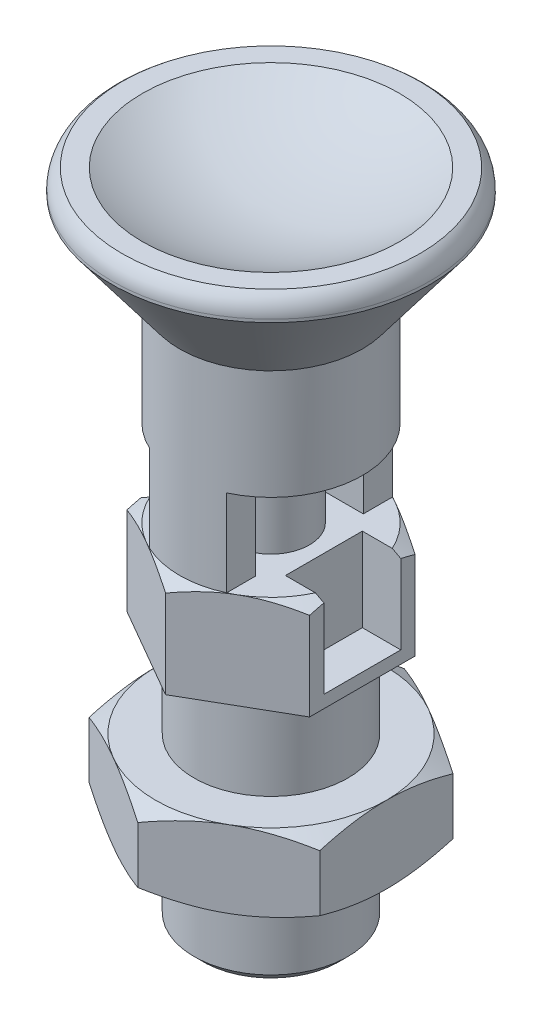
ISO-10303-21;
HEADER;
FILE_DESCRIPTION(('STEP AP214'),'2;1');
FILE_NAME('part.step','',(''),(''),'','','');
FILE_SCHEMA(('AUTOMOTIVE_DESIGN { 1 0 10303 214 1 1 1 1 }'));
ENDSEC;
DATA;
#1=APPLICATION_CONTEXT('core data for automotive mechanical design processes');
#2=APPLICATION_PROTOCOL_DEFINITION('international standard','automotive_design',2000,#1);
#3=PRODUCT_CONTEXT('',#1,'mechanical');
#4=PRODUCT('Part','Part','',(#3));
#5=PRODUCT_RELATED_PRODUCT_CATEGORY('part','',(#4));
#6=PRODUCT_DEFINITION_FORMATION('','',#4);
#7=PRODUCT_DEFINITION_CONTEXT('part definition',#1,'design');
#8=PRODUCT_DEFINITION('design','',#6,#7);
#9=PRODUCT_DEFINITION_SHAPE('','',#8);
#10=(LENGTH_UNIT() NAMED_UNIT(*) SI_UNIT(.MILLI.,.METRE.));
#11=(NAMED_UNIT(*) PLANE_ANGLE_UNIT() SI_UNIT($,.RADIAN.));
#12=(NAMED_UNIT(*) SI_UNIT($,.STERADIAN.) SOLID_ANGLE_UNIT());
#13=UNCERTAINTY_MEASURE_WITH_UNIT(LENGTH_MEASURE(1.E-05),#10,'distance_accuracy_value','');
#14=(GEOMETRIC_REPRESENTATION_CONTEXT(3) GLOBAL_UNCERTAINTY_ASSIGNED_CONTEXT((#13)) GLOBAL_UNIT_ASSIGNED_CONTEXT((#10,
#11,#12)) REPRESENTATION_CONTEXT('',''));
#15=CARTESIAN_POINT('',(0.,0.,0.));
#16=DIRECTION('',(0.,0.,1.));
#17=DIRECTION('',(1.,0.,0.));
#18=AXIS2_PLACEMENT_3D('',#15,#16,#17);
#19=CARTESIAN_POINT('',(-6.50651407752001E-11,7.99999999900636,3.0139085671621E-11));
#20=DIRECTION('',(0.,-1.,0.));
#21=DIRECTION('',(0.,0.,-1.));
#22=AXIS2_PLACEMENT_3D('',#19,#20,#21);
#23=PLANE('',#22);
#24=DIRECTION('',(0.,0.,1.));
#25=VECTOR('',#24,1.);
#26=CARTESIAN_POINT('',(-3.99999999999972,7.99999999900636,-8.6168439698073));
#27=LINE('',#26,#25);
#28=CARTESIAN_POINT('',(-3.99999999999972,7.99999999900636,-5.59999999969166));
#29=VERTEX_POINT('',#28);
#30=CARTESIAN_POINT('',(-3.99999999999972,7.99999999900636,3.0139085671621E-11));
#31=VERTEX_POINT('',#30);
#32=EDGE_CURVE('E617',#29,#31,#27,.T.);
#33=ORIENTED_EDGE('',*,*,#32,.F.);
#34=DIRECTION('',(1.,0.,0.));
#35=VECTOR('',#34,1.);
#36=CARTESIAN_POINT('',(-3.99999999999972,7.99999999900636,-5.59999999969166));
#37=LINE('',#36,#35);
#38=CARTESIAN_POINT('',(3.99999999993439,7.99999999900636,-5.59999999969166));
#39=VERTEX_POINT('',#38);
#40=EDGE_CURVE('E643',#29,#39,#37,.T.);
#41=ORIENTED_EDGE('',*,*,#40,.T.);
#42=DIRECTION('',(0.,0.,1.));
#43=VECTOR('',#42,1.);
#44=CARTESIAN_POINT('',(3.99999999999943,7.99999999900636,-8.61684396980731));
#45=LINE('',#44,#43);
#46=CARTESIAN_POINT('',(3.99999999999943,7.99999999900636,3.0139085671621E-11));
#47=VERTEX_POINT('',#46);
#48=EDGE_CURVE('E625',#39,#47,#45,.T.);
#49=ORIENTED_EDGE('',*,*,#48,.T.);
#50=CARTESIAN_POINT('',(-6.50651407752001E-11,7.99999999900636,3.0139085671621E-11));
#51=DIRECTION('',(0.,-1.,0.));
#52=DIRECTION('',(0.,0.,1.));
#53=AXIS2_PLACEMENT_3D('',#50,#51,#52);
#54=CIRCLE('',#53,4.00000000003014);
#55=EDGE_CURVE('E621',#31,#47,#54,.T.);
#56=ORIENTED_EDGE('',*,*,#55,.F.);
#57=EDGE_LOOP('',(#33,#41,#49,#56));
#58=FACE_BOUND('',#57,.T.);
#59=ADVANCED_FACE('F45',(#58),#23,.T.);
#60=CARTESIAN_POINT('',(0.,0.,0.));
#61=DIRECTION('',(0.,1.,0.));
#62=DIRECTION('',(0.,0.,1.));
#63=AXIS2_PLACEMENT_3D('',#60,#61,#62);
#64=PLANE('',#63);
#65=DIRECTION('',(-1.,0.,0.));
#66=VECTOR('',#65,1.);
#67=CARTESIAN_POINT('',(-5.5,0.,-4.));
#68=LINE('',#67,#66);
#69=CARTESIAN_POINT('',(-5.5,0.,-4.));
#70=VERTEX_POINT('',#69);
#71=CARTESIAN_POINT('',(-8.61684397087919,0.,-4.));
#72=VERTEX_POINT('',#71);
#73=EDGE_CURVE('E4462',#70,#72,#68,.T.);
#74=ORIENTED_EDGE('',*,*,#73,.F.);
#75=DIRECTION('',(0.,0.,-1.));
#76=VECTOR('',#75,1.);
#77=CARTESIAN_POINT('',(-5.5,0.,4.));
#78=LINE('',#77,#76);
#79=CARTESIAN_POINT('',(-5.5,0.,4.));
#80=VERTEX_POINT('',#79);
#81=EDGE_CURVE('E4455',#80,#70,#78,.T.);
#82=ORIENTED_EDGE('',*,*,#81,.F.);
#83=DIRECTION('',(-1.,0.,0.));
#84=VECTOR('',#83,1.);
#85=CARTESIAN_POINT('',(-5.5,0.,4.));
#86=LINE('',#85,#84);
#87=CARTESIAN_POINT('',(-8.61684397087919,0.,4.));
#88=VERTEX_POINT('',#87);
#89=EDGE_CURVE('E4461',#80,#88,#86,.T.);
#90=ORIENTED_EDGE('',*,*,#89,.T.);
#91=CARTESIAN_POINT('',(0.,1.98728869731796E-09,0.));
#92=DIRECTION('',(0.,-1.,0.));
#93=DIRECTION('',(0.,0.,-1.));
#94=AXIS2_PLACEMENT_3D('',#91,#92,#93);
#95=CIRCLE('',#94,9.50000000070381);
#96=CARTESIAN_POINT('',(-4.75000000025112,0.,8.22724133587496));
#97=VERTEX_POINT('',#96);
#98=EDGE_CURVE('E448',#88,#97,#95,.F.);
#99=ORIENTED_EDGE('',*,*,#98,.T.);
#100=CARTESIAN_POINT('',(0.,7.45056794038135E-10,0.));
#101=DIRECTION('',(0.,-1.,0.));
#102=DIRECTION('',(0.,0.,-1.));
#103=AXIS2_PLACEMENT_3D('',#100,#101,#102);
#104=CIRCLE('',#103,9.5);
#105=CARTESIAN_POINT('',(-3.99999999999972,0.,8.61684396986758));
#106=VERTEX_POINT('',#105);
#107=EDGE_CURVE('E311',#97,#106,#104,.F.);
#108=ORIENTED_EDGE('',*,*,#107,.T.);
#109=DIRECTION('',(0.,0.,1.));
#110=VECTOR('',#109,1.);
#111=CARTESIAN_POINT('',(-3.99999999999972,0.,5.6));
#112=LINE('',#111,#110);
#113=CARTESIAN_POINT('',(-3.99999999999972,0.,5.6));
#114=VERTEX_POINT('',#113);
#115=EDGE_CURVE('E652',#114,#106,#112,.T.);
#116=ORIENTED_EDGE('',*,*,#115,.F.);
#117=DIRECTION('',(-1.,0.,0.));
#118=VECTOR('',#117,1.);
#119=CARTESIAN_POINT('',(3.99999999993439,0.,5.6));
#120=LINE('',#119,#118);
#121=CARTESIAN_POINT('',(3.99999999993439,0.,5.6));
#122=VERTEX_POINT('',#121);
#123=EDGE_CURVE('E649',#122,#114,#120,.T.);
#124=ORIENTED_EDGE('',*,*,#123,.F.);
#125=DIRECTION('',(0.,0.,-1.));
#126=VECTOR('',#125,1.);
#127=CARTESIAN_POINT('',(3.99999999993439,0.,8.6168439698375));
#128=LINE('',#127,#126);
#129=CARTESIAN_POINT('',(3.99999999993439,0.,8.6168439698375));
#130=VERTEX_POINT('',#129);
#131=EDGE_CURVE('E633',#130,#122,#128,.T.);
#132=ORIENTED_EDGE('',*,*,#131,.F.);
#133=CARTESIAN_POINT('',(-6.50651407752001E-11,0.,3.0139085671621E-11));
#134=DIRECTION('',(0.,-1.,0.));
#135=DIRECTION('',(0.,0.,-1.));
#136=AXIS2_PLACEMENT_3D('',#133,#134,#135);
#137=CIRCLE('',#136,9.50000000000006);
#138=CARTESIAN_POINT('',(4.74999999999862,0.,8.22724133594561));
#139=VERTEX_POINT('',#138);
#140=EDGE_CURVE('E630',#139,#130,#137,.T.);
#141=ORIENTED_EDGE('',*,*,#140,.F.);
#142=CARTESIAN_POINT('',(0.,1.52698784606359E-09,0.));
#143=DIRECTION('',(0.,-1.,0.));
#144=DIRECTION('',(0.,0.,-1.));
#145=AXIS2_PLACEMENT_3D('',#142,#143,#144);
#146=CIRCLE('',#145,9.50000000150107);
#147=CARTESIAN_POINT('',(8.61684397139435,0.,4.));
#148=VERTEX_POINT('',#147);
#149=EDGE_CURVE('E1929',#139,#148,#146,.F.);
#150=ORIENTED_EDGE('',*,*,#149,.T.);
#151=DIRECTION('',(1.,0.,0.));
#152=VECTOR('',#151,1.);
#153=CARTESIAN_POINT('',(5.5,0.,4.));
#154=LINE('',#153,#152);
#155=CARTESIAN_POINT('',(5.5,0.,4.));
#156=VERTEX_POINT('',#155);
#157=EDGE_CURVE('E637',#156,#148,#154,.T.);
#158=ORIENTED_EDGE('',*,*,#157,.F.);
#159=DIRECTION('',(0.,0.,1.));
#160=VECTOR('',#159,1.);
#161=CARTESIAN_POINT('',(5.5,0.,-4.));
#162=LINE('',#161,#160);
#163=CARTESIAN_POINT('',(5.5,0.,-4.));
#164=VERTEX_POINT('',#163);
#165=EDGE_CURVE('E4498',#164,#156,#162,.T.);
#166=ORIENTED_EDGE('',*,*,#165,.F.);
#167=DIRECTION('',(1.,0.,0.));
#168=VECTOR('',#167,1.);
#169=CARTESIAN_POINT('',(5.5,0.,-4.));
#170=LINE('',#169,#168);
#171=CARTESIAN_POINT('',(8.61684397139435,0.,-4.));
#172=VERTEX_POINT('',#171);
#173=EDGE_CURVE('E641',#164,#172,#170,.T.);
#174=ORIENTED_EDGE('',*,*,#173,.T.);
#175=CARTESIAN_POINT('',(0.,1.98728869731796E-09,0.));
#176=DIRECTION('',(0.,-1.,0.));
#177=DIRECTION('',(0.,0.,-1.));
#178=AXIS2_PLACEMENT_3D('',#175,#176,#177);
#179=CIRCLE('',#178,9.50000000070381);
#180=CARTESIAN_POINT('',(4.75000000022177,9.93644402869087E-10,-8.22724133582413));
#181=VERTEX_POINT('',#180);
#182=EDGE_CURVE('E175',#172,#181,#179,.F.);
#183=ORIENTED_EDGE('',*,*,#182,.T.);
#184=CARTESIAN_POINT('',(0.,7.45056794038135E-10,0.));
#185=DIRECTION('',(0.,-1.,0.));
#186=DIRECTION('',(0.,0.,-1.));
#187=AXIS2_PLACEMENT_3D('',#184,#185,#186);
#188=CIRCLE('',#187,9.5);
#189=CARTESIAN_POINT('',(3.99999999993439,0.,-8.61684396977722));
#190=VERTEX_POINT('',#189);
#191=EDGE_CURVE('E689',#181,#190,#188,.F.);
#192=ORIENTED_EDGE('',*,*,#191,.T.);
#193=DIRECTION('',(0.,0.,-1.));
#194=VECTOR('',#193,1.);
#195=CARTESIAN_POINT('',(3.99999999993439,0.,-5.59999999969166));
#196=LINE('',#195,#194);
#197=CARTESIAN_POINT('',(3.99999999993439,0.,-5.59999999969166));
#198=VERTEX_POINT('',#197);
#199=EDGE_CURVE('E644',#198,#190,#196,.T.);
#200=ORIENTED_EDGE('',*,*,#199,.F.);
#201=DIRECTION('',(1.,0.,0.));
#202=VECTOR('',#201,1.);
#203=CARTESIAN_POINT('',(-3.99999999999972,0.,-5.59999999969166));
#204=LINE('',#203,#202);
#205=CARTESIAN_POINT('',(-3.99999999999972,0.,-5.59999999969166));
#206=VERTEX_POINT('',#205);
#207=EDGE_CURVE('E662',#206,#198,#204,.T.);
#208=ORIENTED_EDGE('',*,*,#207,.F.);
#209=DIRECTION('',(0.,0.,1.));
#210=VECTOR('',#209,1.);
#211=CARTESIAN_POINT('',(-3.99999999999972,0.,-8.6168439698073));
#212=LINE('',#211,#210);
#213=CARTESIAN_POINT('',(-3.99999999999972,0.,-8.6168439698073));
#214=VERTEX_POINT('',#213);
#215=EDGE_CURVE('E659',#214,#206,#212,.T.);
#216=ORIENTED_EDGE('',*,*,#215,.F.);
#217=CARTESIAN_POINT('',(-6.50651407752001E-11,0.,3.0139085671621E-11));
#218=DIRECTION('',(0.,-1.,0.));
#219=DIRECTION('',(0.,0.,-1.));
#220=AXIS2_PLACEMENT_3D('',#217,#218,#219);
#221=CIRCLE('',#220,9.50000000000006);
#222=CARTESIAN_POINT('',(-4.75000000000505,0.,-8.22724133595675));
#223=VERTEX_POINT('',#222);
#224=EDGE_CURVE('E655',#223,#214,#221,.T.);
#225=ORIENTED_EDGE('',*,*,#224,.F.);
#226=CARTESIAN_POINT('',(0.,1.52698882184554E-09,0.));
#227=DIRECTION('',(0.,-1.,0.));
#228=DIRECTION('',(0.,0.,-1.));
#229=AXIS2_PLACEMENT_3D('',#226,#227,#228);
#230=CIRCLE('',#229,9.50000000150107);
#231=EDGE_CURVE('E1917',#223,#72,#230,.F.);
#232=ORIENTED_EDGE('',*,*,#231,.T.);
#233=EDGE_LOOP('',(#74,#82,#90,#99,#108,#116,#124,#132,#141,#150,#158,#166,#174,#183,#192,#200,
#208,#216,#225,#232));
#234=FACE_BOUND('',#233,.T.);
#235=CARTESIAN_POINT('',(-6.50651407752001E-11,0.,3.0139085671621E-11));
#236=DIRECTION('',(0.,-1.,0.));
#237=DIRECTION('',(0.,0.,1.));
#238=AXIS2_PLACEMENT_3D('',#235,#236,#237);
#239=CIRCLE('',#238,4.00000000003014);
#240=CARTESIAN_POINT('',(-6.50651407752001E-11,0.,4.00000000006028));
#241=VERTEX_POINT('',#240);
#242=EDGE_CURVE('E627',#241,#241,#239,.T.);
#243=ORIENTED_EDGE('',*,*,#242,.T.);
#244=EDGE_LOOP('',(#243));
#245=FACE_BOUND('',#244,.T.);
#246=ADVANCED_FACE('F572',(#234,#245),#64,.T.);
#247=CARTESIAN_POINT('',(0.,10.2,0.));
#248=DIRECTION('',(0.,-1.,0.));
#249=DIRECTION('',(0.,0.,-1.));
#250=AXIS2_PLACEMENT_3D('',#247,#248,#249);
#251=CYLINDRICAL_SURFACE('',#250,9.5);
#252=CARTESIAN_POINT('',(-6.50651407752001E-11,8.99999999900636,3.0139085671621E-11));
#253=DIRECTION('',(0.,-1.,0.));
#254=DIRECTION('',(0.,0.,-1.));
#255=AXIS2_PLACEMENT_3D('',#252,#253,#254);
#256=CIRCLE('',#255,9.50000000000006);
#257=CARTESIAN_POINT('',(-3.99999999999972,8.99999999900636,8.61684396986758));
#258=VERTEX_POINT('',#257);
#259=CARTESIAN_POINT('',(-3.99999999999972,8.99999999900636,-8.6168439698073));
#260=VERTEX_POINT('',#259);
#261=EDGE_CURVE('E4429',#258,#260,#256,.T.);
#262=ORIENTED_EDGE('',*,*,#261,.F.);
#263=DIRECTION('',(0.,-1.,0.));
#264=VECTOR('',#263,1.);
#265=CARTESIAN_POINT('',(-3.99999999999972,7.99999999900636,8.61684396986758));
#266=LINE('',#265,#264);
#267=EDGE_CURVE('E678',#258,#106,#266,.T.);
#268=ORIENTED_EDGE('',*,*,#267,.T.);
#269=EDGE_CURVE('E322',#106,#130,#104,.F.);
#270=ORIENTED_EDGE('',*,*,#269,.T.);
#271=DIRECTION('',(0.,-1.,0.));
#272=VECTOR('',#271,1.);
#273=CARTESIAN_POINT('',(3.99999999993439,7.99999999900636,8.6168439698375));
#274=LINE('',#273,#272);
#275=CARTESIAN_POINT('',(3.99999999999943,9.,8.61684396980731));
#276=VERTEX_POINT('',#275);
#277=EDGE_CURVE('E645',#276,#130,#274,.T.);
#278=ORIENTED_EDGE('',*,*,#277,.F.);
#279=CARTESIAN_POINT('',(0.,9.,0.));
#280=DIRECTION('',(0.,1.,0.));
#281=DIRECTION('',(0.,0.,1.));
#282=AXIS2_PLACEMENT_3D('',#279,#280,#281);
#283=CIRCLE('',#282,9.5);
#284=CARTESIAN_POINT('',(3.99999999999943,9.,-8.61684396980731));
#285=VERTEX_POINT('',#284);
#286=EDGE_CURVE('E4439',#276,#285,#283,.T.);
#287=ORIENTED_EDGE('',*,*,#286,.T.);
#288=DIRECTION('',(0.,-1.,0.));
#289=VECTOR('',#288,1.);
#290=CARTESIAN_POINT('',(3.99999999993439,7.99999999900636,-8.61684396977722));
#291=LINE('',#290,#289);
#292=EDGE_CURVE('E287',#285,#190,#291,.T.);
#293=ORIENTED_EDGE('',*,*,#292,.T.);
#294=EDGE_CURVE('E310',#190,#214,#188,.F.);
#295=ORIENTED_EDGE('',*,*,#294,.T.);
#296=DIRECTION('',(0.,-1.,0.));
#297=VECTOR('',#296,1.);
#298=CARTESIAN_POINT('',(-3.99999999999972,7.99999999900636,-8.6168439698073));
#299=LINE('',#298,#297);
#300=EDGE_CURVE('E675',#260,#214,#299,.T.);
#301=ORIENTED_EDGE('',*,*,#300,.F.);
#302=EDGE_LOOP('',(#262,#268,#270,#278,#287,#293,#295,#301));
#303=FACE_BOUND('',#302,.T.);
#304=CARTESIAN_POINT('',(0.,20.3999999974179,0.));
#305=DIRECTION('',(0.,1.,0.));
#306=DIRECTION('',(1.,0.,0.));
#307=AXIS2_PLACEMENT_3D('',#304,#305,#306);
#308=CIRCLE('',#307,9.50000000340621);
#309=CARTESIAN_POINT('',(9.50000000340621,20.3999999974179,0.));
#310=VERTEX_POINT('',#309);
#311=EDGE_CURVE('E693',#310,#310,#308,.T.);
#312=ORIENTED_EDGE('',*,*,#311,.F.);
#313=EDGE_LOOP('',(#312));
#314=FACE_BOUND('',#313,.T.);
#315=ADVANCED_FACE('F579',(#303,#314),#251,.T.);
#316=CARTESIAN_POINT('',(1.33604719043,-36.,0.));
#317=DIRECTION('',(0.,-1.,0.));
#318=DIRECTION('',(0.,0.,-1.));
#319=AXIS2_PLACEMENT_3D('',#316,#317,#318);
#320=PLANE('',#319);
#321=CARTESIAN_POINT('',(0.,-36.0000000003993,0.));
#322=DIRECTION('',(0.,1.,0.));
#323=DIRECTION('',(0.,0.,1.));
#324=AXIS2_PLACEMENT_3D('',#321,#322,#323);
#325=CIRCLE('',#324,2.67209438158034);
#326=CARTESIAN_POINT('',(0.,-36.0000000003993,2.67209438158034));
#327=VERTEX_POINT('',#326);
#328=EDGE_CURVE('E281',#327,#327,#325,.T.);
#329=ORIENTED_EDGE('',*,*,#328,.F.);
#330=EDGE_LOOP('',(#329));
#331=FACE_BOUND('',#330,.T.);
#332=ADVANCED_FACE('F1171',(#331),#320,.T.);
#333=CARTESIAN_POINT('',(0.,-33.6999999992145,0.));
#334=DIRECTION('',(0.,1.,0.));
#335=DIRECTION('',(0.,0.,1.));
#336=AXIS2_PLACEMENT_3D('',#333,#334,#335);
#337=CONICAL_SURFACE('',#336,3.99999999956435,0.523598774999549);
#338=ORIENTED_EDGE('',*,*,#328,.T.);
#339=EDGE_LOOP('',(#338));
#340=FACE_BOUND('',#339,.T.);
#341=CARTESIAN_POINT('',(0.,-33.6999999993,0.));
#342=DIRECTION('',(0.,-1.,0.));
#343=DIRECTION('',(0.,0.,-1.));
#344=AXIS2_PLACEMENT_3D('',#341,#342,#343);
#345=CIRCLE('',#344,4.);
#346=CARTESIAN_POINT('',(0.,-33.6999999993,-4.));
#347=VERTEX_POINT('',#346);
#348=EDGE_CURVE('E286',#347,#347,#345,.T.);
#349=ORIENTED_EDGE('',*,*,#348,.T.);
#350=EDGE_LOOP('',(#349));
#351=FACE_BOUND('',#350,.T.);
#352=ADVANCED_FACE('F1166',(#340,#351),#337,.T.);
#353=CARTESIAN_POINT('',(0.,-18.,0.));
#354=DIRECTION('',(0.,-1.,0.));
#355=DIRECTION('',(0.,0.,-1.));
#356=AXIS2_PLACEMENT_3D('',#353,#354,#355);
#357=CYLINDRICAL_SURFACE('',#356,4.);
#358=CARTESIAN_POINT('',(0.,-36.,0.));
#359=DIRECTION('',(0.,-1.,0.));
#360=DIRECTION('',(0.,0.,-1.));
#361=AXIS2_PLACEMENT_3D('',#358,#359,#360);
#362=CIRCLE('',#361,4.);
#363=CARTESIAN_POINT('',(0.,-36.,-4.));
#364=VERTEX_POINT('',#363);
#365=EDGE_CURVE('E288',#364,#364,#362,.F.);
#366=ORIENTED_EDGE('',*,*,#365,.F.);
#367=EDGE_LOOP('',(#366));
#368=FACE_BOUND('',#367,.T.);
#369=ORIENTED_EDGE('',*,*,#348,.F.);
#370=EDGE_LOOP('',(#369));
#371=FACE_BOUND('',#370,.T.);
#372=ADVANCED_FACE('F1163',(#368,#371),#357,.F.);
#373=CARTESIAN_POINT('',(5.54,-36.,0.));
#374=DIRECTION('',(0.,-1.,0.));
#375=DIRECTION('',(0.,0.,-1.));
#376=AXIS2_PLACEMENT_3D('',#373,#374,#375);
#377=PLANE('',#376);
#378=CARTESIAN_POINT('',(0.,-36.,0.));
#379=DIRECTION('',(0.,-1.,0.));
#380=DIRECTION('',(0.,0.,-1.));
#381=AXIS2_PLACEMENT_3D('',#378,#379,#380);
#382=CIRCLE('',#381,7.07999999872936);
#383=CARTESIAN_POINT('',(0.,-36.,-7.07999999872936));
#384=VERTEX_POINT('',#383);
#385=EDGE_CURVE('E54',#384,#384,#382,.T.);
#386=ORIENTED_EDGE('',*,*,#385,.T.);
#387=EDGE_LOOP('',(#386));
#388=FACE_BOUND('',#387,.T.);
#389=ORIENTED_EDGE('',*,*,#365,.T.);
#390=EDGE_LOOP('',(#389));
#391=FACE_BOUND('',#390,.T.);
#392=ADVANCED_FACE('F1161',(#388,#391),#377,.T.);
#393=CARTESIAN_POINT('',(0.,-22.54,0.));
#394=DIRECTION('',(0.,-1.,0.));
#395=DIRECTION('',(0.,0.,-1.));
#396=AXIS2_PLACEMENT_3D('',#393,#394,#395);
#397=CYLINDRICAL_SURFACE('',#396,8.);
#398=CARTESIAN_POINT('',(0.,-35.0800000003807,0.));
#399=DIRECTION('',(0.,-1.,0.));
#400=DIRECTION('',(0.,0.,-1.));
#401=AXIS2_PLACEMENT_3D('',#398,#399,#400);
#402=CIRCLE('',#401,8.);
#403=CARTESIAN_POINT('',(0.,-35.0800000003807,-8.));
#404=VERTEX_POINT('',#403);
#405=EDGE_CURVE('E12',#404,#404,#402,.F.);
#406=ORIENTED_EDGE('',*,*,#405,.T.);
#407=EDGE_LOOP('',(#406));
#408=FACE_BOUND('',#407,.T.);
#409=CARTESIAN_POINT('',(0.,-27.0000000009,0.));
#410=DIRECTION('',(0.,-1.,0.));
#411=DIRECTION('',(0.,0.,-1.));
#412=AXIS2_PLACEMENT_3D('',#409,#410,#411);
#413=CIRCLE('',#412,8.);
#414=CARTESIAN_POINT('',(0.,-27.0000000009,-8.));
#415=VERTEX_POINT('',#414);
#416=EDGE_CURVE('E1145',#415,#415,#413,.F.);
#417=ORIENTED_EDGE('',*,*,#416,.F.);
#418=EDGE_LOOP('',(#417));
#419=FACE_BOUND('',#418,.T.);
#420=ADVANCED_FACE('F1182',(#408,#419),#397,.T.);
#421=CARTESIAN_POINT('',(6.,-27.,0.));
#422=DIRECTION('',(0.,-1.,0.));
#423=DIRECTION('',(0.,0.,-1.));
#424=AXIS2_PLACEMENT_3D('',#421,#422,#423);
#425=PLANE('',#424);
#426=ORIENTED_EDGE('',*,*,#416,.T.);
#427=EDGE_LOOP('',(#426));
#428=FACE_BOUND('',#427,.T.);
#429=CARTESIAN_POINT('',(0.,-27.0000000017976,0.));
#430=DIRECTION('',(0.,1.,0.));
#431=DIRECTION('',(0.,0.,1.));
#432=AXIS2_PLACEMENT_3D('',#429,#430,#431);
#433=CIRCLE('',#432,12.0000000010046);
#434=CARTESIAN_POINT('',(-5.99999999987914,-27.0000000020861,-10.3923048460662));
#435=VERTEX_POINT('',#434);
#436=CARTESIAN_POINT('',(-12.0000000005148,-27.0000000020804,-1.96101271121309E-10));
#437=VERTEX_POINT('',#436);
#438=EDGE_CURVE('E1132',#435,#437,#433,.T.);
#439=ORIENTED_EDGE('',*,*,#438,.F.);
#440=CARTESIAN_POINT('',(0.,-27.0000000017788,0.));
#441=DIRECTION('',(0.,1.,0.));
#442=DIRECTION('',(0.,0.,1.));
#443=AXIS2_PLACEMENT_3D('',#440,#441,#442);
#444=CIRCLE('',#443,12.0000000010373);
#445=CARTESIAN_POINT('',(6.00000000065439,-27.0000000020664,-10.3923048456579));
#446=VERTEX_POINT('',#445);
#447=EDGE_CURVE('E166',#446,#435,#444,.T.);
#448=ORIENTED_EDGE('',*,*,#447,.F.);
#449=CARTESIAN_POINT('',(0.,-27.0000000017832,0.));
#450=DIRECTION('',(0.,1.,0.));
#451=DIRECTION('',(0.,0.,1.));
#452=AXIS2_PLACEMENT_3D('',#449,#450,#451);
#453=CIRCLE('',#452,12.0000000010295);
#454=CARTESIAN_POINT('',(12.0000000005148,-27.0000000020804,1.96099669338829E-10));
#455=VERTEX_POINT('',#454);
#456=EDGE_CURVE('E1131',#455,#446,#453,.T.);
#457=ORIENTED_EDGE('',*,*,#456,.F.);
#458=CARTESIAN_POINT('',(0.,-27.0000000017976,0.));
#459=DIRECTION('',(0.,1.,0.));
#460=DIRECTION('',(0.,0.,1.));
#461=AXIS2_PLACEMENT_3D('',#458,#459,#460);
#462=CIRCLE('',#461,12.0000000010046);
#463=CARTESIAN_POINT('',(5.99999999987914,-27.0000000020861,10.3923048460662));
#464=VERTEX_POINT('',#463);
#465=EDGE_CURVE('E1058',#464,#455,#462,.T.);
#466=ORIENTED_EDGE('',*,*,#465,.F.);
#467=CARTESIAN_POINT('',(0.,-27.0000000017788,0.));
#468=DIRECTION('',(0.,1.,0.));
#469=DIRECTION('',(0.,0.,1.));
#470=AXIS2_PLACEMENT_3D('',#467,#468,#469);
#471=CIRCLE('',#470,12.0000000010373);
#472=CARTESIAN_POINT('',(-6.00000000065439,-27.0000000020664,10.3923048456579));
#473=VERTEX_POINT('',#472);
#474=EDGE_CURVE('E1051',#473,#464,#471,.T.);
#475=ORIENTED_EDGE('',*,*,#474,.F.);
#476=CARTESIAN_POINT('',(0.,-27.0000000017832,0.));
#477=DIRECTION('',(0.,1.,0.));
#478=DIRECTION('',(0.,0.,1.));
#479=AXIS2_PLACEMENT_3D('',#476,#477,#478);
#480=CIRCLE('',#479,12.0000000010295);
#481=EDGE_CURVE('E1126',#437,#473,#480,.T.);
#482=ORIENTED_EDGE('',*,*,#481,.F.);
#483=EDGE_LOOP('',(#439,#448,#457,#466,#475,#482));
#484=FACE_BOUND('',#483,.T.);
#485=ADVANCED_FACE('F1185',(#428,#484),#425,.T.);
#486=CARTESIAN_POINT('',(0.,-25.9217724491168,0.));
#487=DIRECTION('',(0.,1.,0.));
#488=DIRECTION('',(0.,0.,1.));
#489=AXIS2_PLACEMENT_3D('',#486,#487,#488);
#490=CONICAL_SURFACE('',#489,13.8675448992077,1.04719755);
#491=CARTESIAN_POINT('',(6.14288122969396E-10,-25.9282032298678,-13.8564064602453));
#492=CARTESIAN_POINT('',(0.488621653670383,-26.0910592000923,-13.5743006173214));
#493=CARTESIAN_POINT('',(0.98082956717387,-26.2402447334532,-13.2901242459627));
#494=CARTESIAN_POINT('',(1.72302990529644,-26.4377250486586,-12.8616146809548));
#495=CARTESIAN_POINT('',(1.97046434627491,-26.4990499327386,-12.718758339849));
#496=CARTESIAN_POINT('',(2.46695533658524,-26.6122236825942,-12.432109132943));
#497=CARTESIAN_POINT('',(2.71601178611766,-26.6640731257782,-12.288316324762));
#498=CARTESIAN_POINT('',(3.21588348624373,-26.7574697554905,-11.9997152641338));
#499=CARTESIAN_POINT('',(3.46670049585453,-26.7990044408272,-11.8549059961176));
#500=CARTESIAN_POINT('',(3.96953415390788,-26.8708989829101,-11.5645948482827));
#501=CARTESIAN_POINT('',(4.22155077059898,-26.9012591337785,-11.4190929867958));
#502=CARTESIAN_POINT('',(4.72771722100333,-26.950275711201,-11.1268576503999));
#503=CARTESIAN_POINT('',(4.98187141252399,-26.9688726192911,-10.9801216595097));
#504=CARTESIAN_POINT('',(5.49067963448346,-26.9937606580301,-10.6863610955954));
#505=CARTESIAN_POINT('',(5.74533375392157,-27.0000493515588,-10.5393364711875));
#506=CARTESIAN_POINT('',(6.0000000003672,-27.000000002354,-10.3923048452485));
#507=B_SPLINE_CURVE_WITH_KNOTS('',3,(#491,#492,#493,#494,#495,#496,#497,#498,#499,#500,#501,
#502,#503,#504,#505,#506),.UNSPECIFIED.,.F.,.F.,(4,2,2,2,2,2,2,4),(0.,1.76168798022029,
2.63822760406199,3.51471379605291,4.39225713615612,5.26977737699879,6.15170281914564,
7.03380287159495),.UNSPECIFIED.);
#508=CARTESIAN_POINT('',(4.45381829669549E-10,-25.9282032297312,-13.856406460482));
#509=VERTEX_POINT('',#508);
#510=EDGE_CURVE('E1057',#509,#446,#507,.T.);
#511=ORIENTED_EDGE('',*,*,#510,.T.);
#512=ORIENTED_EDGE('',*,*,#447,.T.);
#513=CARTESIAN_POINT('',(-5.9999999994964,-27.000000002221,-10.3923048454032));
#514=CARTESIAN_POINT('',(-5.74533375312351,-27.0000493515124,-10.539336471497));
#515=CARTESIAN_POINT('',(-5.49067963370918,-26.9937606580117,-10.6863610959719));
#516=CARTESIAN_POINT('',(-4.98187141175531,-26.9688726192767,-10.9801216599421));
#517=CARTESIAN_POINT('',(-4.72771722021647,-26.9502757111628,-11.1268576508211));
#518=CARTESIAN_POINT('',(-4.22155076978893,-26.9012591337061,-11.4190929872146));
#519=CARTESIAN_POINT('',(-3.96953415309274,-26.8708989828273,-11.5645948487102));
#520=CARTESIAN_POINT('',(-3.46670049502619,-26.7990044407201,-11.8549059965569));
#521=CARTESIAN_POINT('',(-3.21588348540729,-26.7574697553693,-11.9997152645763));
#522=CARTESIAN_POINT('',(-2.71601178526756,-26.6640731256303,-12.2883163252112));
#523=CARTESIAN_POINT('',(-2.46695533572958,-26.6122236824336,-12.4321091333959));
#524=CARTESIAN_POINT('',(-1.97046434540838,-26.4990499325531,-12.7187583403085));
#525=CARTESIAN_POINT('',(-1.72302990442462,-26.4377250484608,-12.8616146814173));
#526=CARTESIAN_POINT('',(-0.980829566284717,-26.2402447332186,-13.2901242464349));
#527=CARTESIAN_POINT('',(-0.488621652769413,-26.0910591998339,-13.5743006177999));
#528=CARTESIAN_POINT('',(2.9792853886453E-10,-25.9282032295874,-13.856406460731));
#529=B_SPLINE_CURVE_WITH_KNOTS('',3,(#513,#514,#515,#516,#517,#518,#519,#520,#521,#522,#523,
#524,#525,#526,#527,#528),.UNSPECIFIED.,.F.,.F.,(4,2,2,2,2,2,2,4),(0.,0.882100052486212,
1.76402549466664,2.64154573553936,3.5190890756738,4.39557526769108,5.27211489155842,
7.03380287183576),.UNSPECIFIED.);
#530=EDGE_CURVE('E1111',#435,#509,#529,.T.);
#531=ORIENTED_EDGE('',*,*,#530,.T.);
#532=EDGE_LOOP('',(#511,#512,#531));
#533=FACE_BOUND('',#532,.T.);
#534=ADVANCED_FACE('F1098',(#533),#490,.T.);
#535=CARTESIAN_POINT('',(0.,-25.9217724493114,0.));
#536=DIRECTION('',(0.,1.,0.));
#537=DIRECTION('',(0.,0.,1.));
#538=AXIS2_PLACEMENT_3D('',#535,#536,#537);
#539=CONICAL_SURFACE('',#538,13.8675448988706,1.04719755);
#540=CARTESIAN_POINT('',(-11.9999999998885,-25.9282032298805,-6.92820323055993));
#541=CARTESIAN_POINT('',(-11.5113783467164,-26.0910592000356,-7.21030907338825));
#542=CARTESIAN_POINT('',(-11.0191704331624,-26.2402447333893,-7.49448544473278));
#543=CARTESIAN_POINT('',(-10.2769700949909,-26.4377250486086,-7.9229950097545));
#544=CARTESIAN_POINT('',(-10.0295356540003,-26.4990499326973,-8.06585135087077));
#545=CARTESIAN_POINT('',(-9.53304466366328,-26.6122236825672,-8.3525005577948));
#546=CARTESIAN_POINT('',(-9.28398821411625,-26.6640731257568,-8.49629336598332));
#547=CARTESIAN_POINT('',(-8.78411651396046,-26.7574697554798,-8.78489442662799));
#548=CARTESIAN_POINT('',(-8.53329950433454,-26.7990044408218,-8.92970369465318));
#549=CARTESIAN_POINT('',(-8.03046584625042,-26.8708989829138,-9.22001484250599));
#550=CARTESIAN_POINT('',(-7.77844922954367,-26.901259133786,-9.36551670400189));
#551=CARTESIAN_POINT('',(-7.27228277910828,-26.9502757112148,-9.65775204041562));
#552=CARTESIAN_POINT('',(-7.01812858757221,-26.9688726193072,-9.80448803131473));
#553=CARTESIAN_POINT('',(-6.50932036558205,-26.9937606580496,-10.0982485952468));
#554=CARTESIAN_POINT('',(-6.25466624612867,-27.0000493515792,-10.2452732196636));
#555=CARTESIAN_POINT('',(-5.99999999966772,-27.0000000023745,-10.3923048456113));
#556=B_SPLINE_CURVE_WITH_KNOTS('',3,(#540,#541,#542,#543,#544,#545,#546,#547,#548,#549,#550,
#551,#552,#553,#554,#555),.UNSPECIFIED.,.F.,.F.,(4,2,2,2,2,2,2,4),(0.,1.76168798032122,
2.63822760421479,3.5147137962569,4.39225713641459,5.26977737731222,6.15170281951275,
7.03380287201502),.UNSPECIFIED.);
#557=CARTESIAN_POINT('',(-11.9999999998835,-25.9282032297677,-6.92820323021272));
#558=VERTEX_POINT('',#557);
#559=EDGE_CURVE('E1103',#558,#435,#556,.T.);
#560=ORIENTED_EDGE('',*,*,#559,.T.);
#561=ORIENTED_EDGE('',*,*,#438,.T.);
#562=CARTESIAN_POINT('',(-11.9999999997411,-27.0000000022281,-3.92200337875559E-10));
#563=CARTESIAN_POINT('',(-11.999999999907,-27.0000493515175,-0.294063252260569));
#564=CARTESIAN_POINT('',(-11.9999999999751,-26.9937606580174,-0.588112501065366));
#565=CARTESIAN_POINT('',(-12.0000000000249,-26.9688726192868,-1.1756336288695));
#566=CARTESIAN_POINT('',(-12.0000000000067,-26.9502757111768,-1.46910561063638));
#567=CARTESIAN_POINT('',(-11.9999999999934,-26.9012591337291,-2.05357628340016));
#568=CARTESIAN_POINT('',(-11.9999999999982,-26.8708989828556,-2.34458000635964));
#569=CARTESIAN_POINT('',(-12.0000000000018,-26.7990044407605,-2.92520230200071));
#570=CARTESIAN_POINT('',(-12.0000000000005,-26.7574697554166,-3.21482083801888));
#571=CARTESIAN_POINT('',(-11.9999999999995,-26.6640731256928,-3.79202295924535));
#572=CARTESIAN_POINT('',(-11.9999999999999,-26.6122236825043,-4.07960857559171));
#573=CARTESIAN_POINT('',(-12.0000000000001,-26.4990499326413,-4.65290698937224));
#574=CARTESIAN_POINT('',(-12.0000000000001,-26.4377250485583,-4.93861967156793));
#575=CARTESIAN_POINT('',(-11.9999999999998,-26.2402447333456,-5.79563880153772));
#576=CARTESIAN_POINT('',(-11.9999999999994,-26.0910591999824,-6.36399154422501));
#577=CARTESIAN_POINT('',(-12.,-25.9282032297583,-6.92820323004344));
#578=B_SPLINE_CURVE_WITH_KNOTS('',3,(#562,#563,#564,#565,#566,#567,#568,#569,#570,#571,#572,
#573,#574,#575,#576,#577),.UNSPECIFIED.,.F.,.F.,(4,2,2,2,2,2,2,4),(0.,0.882100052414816,
1.764025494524,2.64154573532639,3.51908907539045,4.39557526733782,5.27211489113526,
7.03380287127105),.UNSPECIFIED.);
#579=EDGE_CURVE('E1044',#437,#558,#578,.T.);
#580=ORIENTED_EDGE('',*,*,#579,.T.);
#581=EDGE_LOOP('',(#560,#561,#580));
#582=FACE_BOUND('',#581,.T.);
#583=ADVANCED_FACE('F1092',(#582),#539,.T.);
#584=CARTESIAN_POINT('',(0.,-25.9217724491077,0.));
#585=DIRECTION('',(0.,1.,0.));
#586=DIRECTION('',(0.,0.,1.));
#587=AXIS2_PLACEMENT_3D('',#584,#585,#586);
#588=CONICAL_SURFACE('',#587,13.8675448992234,1.04719755);
#589=CARTESIAN_POINT('',(-12.,-25.9282032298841,6.92820322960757));
#590=CARTESIAN_POINT('',(-12.,-26.0910592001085,6.36399154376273));
#591=CARTESIAN_POINT('',(-12.,-26.2402447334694,5.79563880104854));
#592=CARTESIAN_POINT('',(-12.,-26.437725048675,4.93861967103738));
#593=CARTESIAN_POINT('',(-12.,-26.4990499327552,4.65290698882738));
#594=CARTESIAN_POINT('',(-12.,-26.6122236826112,4.0796085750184));
#595=CARTESIAN_POINT('',(-12.,-26.6640731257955,3.7920229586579));
#596=CARTESIAN_POINT('',(-12.,-26.7574697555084,3.21482083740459));
#597=CARTESIAN_POINT('',(-12.,-26.7990044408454,2.92520230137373));
#598=CARTESIAN_POINT('',(-12.,-26.8708989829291,2.34458000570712));
#599=CARTESIAN_POINT('',(-12.,-26.901259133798,2.05357628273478));
#600=CARTESIAN_POINT('',(-12.,-26.9502757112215,1.46910560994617));
#601=CARTESIAN_POINT('',(-12.,-26.9688726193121,1.17563362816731));
#602=CARTESIAN_POINT('',(-12.,-26.9937606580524,0.588112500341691));
#603=CARTESIAN_POINT('',(-12.,-27.0000493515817,0.294063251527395));
#604=CARTESIAN_POINT('',(-12.,-27.0000000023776,-3.49042162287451E-10));
#605=B_SPLINE_CURVE_WITH_KNOTS('',3,(#589,#590,#591,#592,#593,#594,#595,#596,#597,#598,#599,
#600,#601,#602,#603,#604),.UNSPECIFIED.,.F.,.F.,(4,2,2,2,2,2,2,4),(0.,1.76168798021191,
2.6382276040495,3.51471379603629,4.39225713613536,5.26977737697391,6.15170281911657,
7.03380287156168),.UNSPECIFIED.);
#606=CARTESIAN_POINT('',(-12.0000000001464,-25.9282032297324,6.92820322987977));
#607=VERTEX_POINT('',#606);
#608=EDGE_CURVE('E1043',#607,#437,#605,.T.);
#609=ORIENTED_EDGE('',*,*,#608,.T.);
#610=ORIENTED_EDGE('',*,*,#481,.T.);
#611=CARTESIAN_POINT('',(-6.00000000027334,-27.0000000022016,10.3923048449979));
#612=CARTESIAN_POINT('',(-6.25466624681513,-27.0000493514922,10.2452732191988));
#613=CARTESIAN_POINT('',(-6.50932036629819,-26.9937606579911,10.098248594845));
#614=CARTESIAN_POINT('',(-7.01812858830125,-26.968872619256,9.80448803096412));
#615=CARTESIAN_POINT('',(-7.27228277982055,-26.9502757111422,9.65775204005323));
#616=CARTESIAN_POINT('',(-7.77844923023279,-26.9012591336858,9.36551670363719));
#617=CARTESIAN_POINT('',(-8.0304658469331,-26.8708989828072,9.22001484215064));
#618=CARTESIAN_POINT('',(-8.53329950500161,-26.7990044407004,8.92970369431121));
#619=CARTESIAN_POINT('',(-8.78411651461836,-26.7574697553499,8.78489442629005));
#620=CARTESIAN_POINT('',(-9.28398821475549,-26.6640731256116,8.49629336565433));
#621=CARTESIAN_POINT('',(-9.53304466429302,-26.6122236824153,8.35250055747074));
#622=CARTESIAN_POINT('',(-10.0295356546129,-26.4990499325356,8.06585135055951));
#623=CARTESIAN_POINT('',(-10.2769700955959,-26.4377250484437,7.92299500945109));
#624=CARTESIAN_POINT('',(-11.0191704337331,-26.240244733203,7.49448544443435));
#625=CARTESIAN_POINT('',(-11.5113783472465,-26.0910591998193,7.21030907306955));
#626=CARTESIAN_POINT('',(-12.0000000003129,-25.9282032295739,6.92820323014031));
#627=B_SPLINE_CURVE_WITH_KNOTS('',3,(#611,#612,#613,#614,#615,#616,#617,#618,#619,#620,#621,
#622,#623,#624,#625,#626),.UNSPECIFIED.,.F.,.F.,(4,2,2,2,2,2,2,4),(0.,0.882100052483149,
1.76402549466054,2.64154573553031,3.51908907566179,4.39557526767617,5.27211489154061,
7.033802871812),.UNSPECIFIED.);
#628=EDGE_CURVE('E939',#473,#607,#627,.T.);
#629=ORIENTED_EDGE('',*,*,#628,.T.);
#630=EDGE_LOOP('',(#609,#610,#629));
#631=FACE_BOUND('',#630,.T.);
#632=ADVANCED_FACE('F1088',(#631),#588,.T.);
#633=CARTESIAN_POINT('',(0.,-25.9217724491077,0.));
#634=DIRECTION('',(0.,1.,0.));
#635=DIRECTION('',(0.,0.,1.));
#636=AXIS2_PLACEMENT_3D('',#633,#634,#635);
#637=CONICAL_SURFACE('',#636,13.8675448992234,1.04719755);
#638=ORIENTED_EDGE('',*,*,#456,.T.);
#639=CARTESIAN_POINT('',(6.00000000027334,-27.0000000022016,-10.3923048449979));
#640=CARTESIAN_POINT('',(6.25466624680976,-27.0000493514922,-10.2452732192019));
#641=CARTESIAN_POINT('',(6.50932036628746,-26.9937606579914,-10.0982485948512));
#642=CARTESIAN_POINT('',(7.01812858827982,-26.9688726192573,-9.80448803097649));
#643=CARTESIAN_POINT('',(7.27228277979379,-26.9502757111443,-9.65775204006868));
#644=CARTESIAN_POINT('',(7.77844923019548,-26.90125913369,-9.36551670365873));
#645=CARTESIAN_POINT('',(8.03046584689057,-26.8708989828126,-9.22001484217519));
#646=CARTESIAN_POINT('',(8.53329950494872,-26.7990044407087,-8.92970369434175));
#647=CARTESIAN_POINT('',(8.78411651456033,-26.7574697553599,-8.78489442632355));
#648=CARTESIAN_POINT('',(9.28398821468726,-26.6640731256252,-8.49629336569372));
#649=CARTESIAN_POINT('',(9.53304466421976,-26.612223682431,-8.35250055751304));
#650=CARTESIAN_POINT('',(10.0295356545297,-26.4990499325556,-8.06585135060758));
#651=CARTESIAN_POINT('',(10.2769700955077,-26.437725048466,-7.92299500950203));
#652=CARTESIAN_POINT('',(11.01917043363,-26.2402447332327,-7.49448544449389));
#653=CARTESIAN_POINT('',(11.5113783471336,-26.0910591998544,-7.21030907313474));
#654=CARTESIAN_POINT('',(12.0000000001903,-25.9282032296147,-6.92820323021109));
#655=B_SPLINE_CURVE_WITH_KNOTS('',3,(#639,#640,#641,#642,#643,#644,#645,#646,#647,#648,#649,
#650,#651,#652,#653,#654),.UNSPECIFIED.,.F.,.F.,(4,2,2,2,2,2,2,4),(0.,0.882100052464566,
1.76402549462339,2.64154573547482,3.51908907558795,4.39557526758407,5.27211489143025,
7.03380287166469),.UNSPECIFIED.);
#656=CARTESIAN_POINT('',(12.000000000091,-25.9282032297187,-6.92820323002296));
#657=VERTEX_POINT('',#656);
#658=EDGE_CURVE('E1204',#446,#657,#655,.T.);
#659=ORIENTED_EDGE('',*,*,#658,.T.);
#660=CARTESIAN_POINT('',(12.,-25.9282032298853,-6.92820322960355));
#661=CARTESIAN_POINT('',(12.,-26.0910592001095,-6.36399154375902));
#662=CARTESIAN_POINT('',(12.,-26.2402447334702,-5.79563880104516));
#663=CARTESIAN_POINT('',(12.,-26.4377250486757,-4.93861967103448));
#664=CARTESIAN_POINT('',(12.,-26.4990499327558,-4.65290698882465));
#665=CARTESIAN_POINT('',(12.,-26.6122236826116,-4.079608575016));
#666=CARTESIAN_POINT('',(12.,-26.6640731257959,-3.79202295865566));
#667=CARTESIAN_POINT('',(12.,-26.7574697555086,-3.21482083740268));
#668=CARTESIAN_POINT('',(12.,-26.7990044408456,-2.92520230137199));
#669=CARTESIAN_POINT('',(12.,-26.8708989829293,-2.34458000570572));
#670=CARTESIAN_POINT('',(12.,-26.9012591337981,-2.05357628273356));
#671=CARTESIAN_POINT('',(12.,-26.9502757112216,-1.46910560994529));
#672=CARTESIAN_POINT('',(12.,-26.9688726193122,-1.17563362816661));
#673=CARTESIAN_POINT('',(12.,-26.9937606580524,-0.588112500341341));
#674=CARTESIAN_POINT('',(12.,-27.0000493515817,-0.294063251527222));
#675=CARTESIAN_POINT('',(12.,-27.0000000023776,3.49039158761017E-10));
#676=B_SPLINE_CURVE_WITH_KNOTS('',3,(#660,#661,#662,#663,#664,#665,#666,#667,#668,#669,#670,
#671,#672,#673,#674,#675),.UNSPECIFIED.,.F.,.F.,(4,2,2,2,2,2,2,4),(0.,1.76168798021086,
2.63822760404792,3.51471379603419,4.39225713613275,5.26977737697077,6.1517028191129,
7.03380287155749),.UNSPECIFIED.);
#677=EDGE_CURVE('E934',#657,#455,#676,.T.);
#678=ORIENTED_EDGE('',*,*,#677,.T.);
#679=EDGE_LOOP('',(#638,#659,#678));
#680=FACE_BOUND('',#679,.T.);
#681=ADVANCED_FACE('F1091',(#680),#637,.T.);
#682=CARTESIAN_POINT('',(0.,-25.9217724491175,0.));
#683=DIRECTION('',(0.,1.,0.));
#684=DIRECTION('',(0.,0.,1.));
#685=AXIS2_PLACEMENT_3D('',#682,#683,#684);
#686=CONICAL_SURFACE('',#685,13.8675448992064,1.04719755);
#687=ORIENTED_EDGE('',*,*,#465,.T.);
#688=CARTESIAN_POINT('',(11.9999999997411,-27.0000000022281,3.92198603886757E-10));
#689=CARTESIAN_POINT('',(11.999999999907,-27.0000493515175,0.294063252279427));
#690=CARTESIAN_POINT('',(11.9999999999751,-26.9937606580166,0.588112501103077));
#691=CARTESIAN_POINT('',(12.0000000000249,-26.9688726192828,1.1756336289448));
#692=CARTESIAN_POINT('',(12.0000000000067,-26.9502757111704,1.46910561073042));
#693=CARTESIAN_POINT('',(11.9999999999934,-26.9012591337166,2.05357628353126));
#694=CARTESIAN_POINT('',(11.9999999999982,-26.8708989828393,2.34458000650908));
#695=CARTESIAN_POINT('',(12.0000000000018,-26.7990044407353,2.92520230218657));
#696=CARTESIAN_POINT('',(12.0000000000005,-26.7574697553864,3.21482083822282));
#697=CARTESIAN_POINT('',(11.9999999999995,-26.6640731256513,3.7920229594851));
#698=CARTESIAN_POINT('',(11.9999999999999,-26.6122236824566,4.07960857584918));
#699=CARTESIAN_POINT('',(12.0000000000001,-26.4990499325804,4.65290698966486));
#700=CARTESIAN_POINT('',(12.0000000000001,-26.4377250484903,4.93861967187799));
#701=CARTESIAN_POINT('',(11.9999999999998,-26.2402447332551,5.79563880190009));
#702=CARTESIAN_POINT('',(11.9999999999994,-26.0910591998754,6.36399154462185));
#703=CARTESIAN_POINT('',(12.,-25.9282032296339,6.92820323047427));
#704=B_SPLINE_CURVE_WITH_KNOTS('',3,(#688,#689,#690,#691,#692,#693,#694,#695,#696,#697,#698,
#699,#700,#701,#702,#703),.UNSPECIFIED.,.F.,.F.,(4,2,2,2,2,2,2,4),(0.,0.882100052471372,
1.76402549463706,2.64154573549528,3.51908907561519,4.39557526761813,5.27211489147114,
7.0338028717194),.UNSPECIFIED.);
#705=CARTESIAN_POINT('',(11.9999999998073,-25.9282032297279,6.92820323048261));
#706=VERTEX_POINT('',#705);
#707=EDGE_CURVE('E1035',#455,#706,#704,.T.);
#708=ORIENTED_EDGE('',*,*,#707,.T.);
#709=CARTESIAN_POINT('',(11.9999999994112,-25.9282032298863,6.92820323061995));
#710=CARTESIAN_POINT('',(11.5113783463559,-26.0910592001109,7.21030907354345));
#711=CARTESIAN_POINT('',(11.0191704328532,-26.2402447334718,7.49448544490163));
#712=CARTESIAN_POINT('',(10.2769700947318,-26.4377250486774,7.92299500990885));
#713=CARTESIAN_POINT('',(10.0295356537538,-26.4990499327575,8.06585135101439));
#714=CARTESIAN_POINT('',(9.53304466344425,-26.6122236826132,8.35250055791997));
#715=CARTESIAN_POINT('',(9.28398821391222,-26.6640731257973,8.49629336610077));
#716=CARTESIAN_POINT('',(8.78411651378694,-26.7574697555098,8.78489442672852));
#717=CARTESIAN_POINT('',(8.53329950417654,-26.7990044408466,8.9297036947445));
#718=CARTESIAN_POINT('',(8.03046584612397,-26.8708989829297,9.2200148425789));
#719=CARTESIAN_POINT('',(7.77844922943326,-26.9012591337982,9.36551670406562));
#720=CARTESIAN_POINT('',(7.27228277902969,-26.9502757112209,9.65775204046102));
#721=CARTESIAN_POINT('',(7.01812858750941,-26.9688726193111,9.804488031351));
#722=CARTESIAN_POINT('',(6.5093203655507,-26.9937606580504,10.0982485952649));
#723=CARTESIAN_POINT('',(6.25466624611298,-27.0000493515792,10.2452732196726));
#724=CARTESIAN_POINT('',(5.99999999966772,-27.0000000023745,10.3923048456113));
#725=B_SPLINE_CURVE_WITH_KNOTS('',3,(#709,#710,#711,#712,#713,#714,#715,#716,#717,#718,#719,
#720,#721,#722,#723,#724),.UNSPECIFIED.,.F.,.F.,(4,2,2,2,2,2,2,4),(0.,1.76168798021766,
2.63822760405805,3.51471379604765,4.39225713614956,5.26977737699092,6.15170281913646,
7.03380287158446),.UNSPECIFIED.);
#726=EDGE_CURVE('E896',#706,#464,#725,.T.);
#727=ORIENTED_EDGE('',*,*,#726,.T.);
#728=EDGE_LOOP('',(#687,#708,#727));
#729=FACE_BOUND('',#728,.T.);
#730=ADVANCED_FACE('F915',(#729),#686,.T.);
#731=CARTESIAN_POINT('',(0.,-25.921772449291,0.));
#732=DIRECTION('',(0.,1.,0.));
#733=DIRECTION('',(0.,0.,1.));
#734=AXIS2_PLACEMENT_3D('',#731,#732,#733);
#735=CONICAL_SURFACE('',#734,13.8675448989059,1.04719755);
#736=ORIENTED_EDGE('',*,*,#474,.T.);
#737=CARTESIAN_POINT('',(5.9999999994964,-27.000000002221,10.3923048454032));
#738=CARTESIAN_POINT('',(5.74533375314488,-27.0000493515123,10.5393364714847));
#739=CARTESIAN_POINT('',(5.4906796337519,-26.9937606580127,10.6863610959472));
#740=CARTESIAN_POINT('',(4.98187141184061,-26.9688726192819,10.9801216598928));
#741=CARTESIAN_POINT('',(4.727717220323,-26.9502757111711,11.1268576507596));
#742=CARTESIAN_POINT('',(4.22155076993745,-26.9012591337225,11.4190929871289));
#743=CARTESIAN_POINT('',(3.96953415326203,-26.8708989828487,11.5645948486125));
#744=CARTESIAN_POINT('',(3.46670049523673,-26.799004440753,11.8549059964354));
#745=CARTESIAN_POINT('',(3.21588348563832,-26.7574697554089,11.9997152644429));
#746=CARTESIAN_POINT('',(2.71601178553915,-26.6640731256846,12.2883163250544));
#747=CARTESIAN_POINT('',(2.46695533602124,-26.612223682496,12.4321091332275));
#748=CARTESIAN_POINT('',(1.97046434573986,-26.4990499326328,12.7187583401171));
#749=CARTESIAN_POINT('',(1.72302990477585,-26.4377250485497,12.8616146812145));
#750=CARTESIAN_POINT('',(0.980829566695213,-26.240244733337,13.2901242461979));
#751=CARTESIAN_POINT('',(0.488621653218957,-26.0910591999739,13.5743006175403));
#752=CARTESIAN_POINT('',(1.90119835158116E-10,-25.9282032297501,13.8564064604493));
#753=B_SPLINE_CURVE_WITH_KNOTS('',3,(#737,#738,#739,#740,#741,#742,#743,#744,#745,#746,#747,
#748,#749,#750,#751,#752),.UNSPECIFIED.,.F.,.F.,(4,2,2,2,2,2,2,4),(0.,0.882100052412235,
1.76402549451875,2.64154573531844,3.51908907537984,4.39557526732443,5.27211489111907,
7.0338028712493),.UNSPECIFIED.);
#754=CARTESIAN_POINT('',(-1.58350171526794E-11,-25.9282032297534,13.8564064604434));
#755=VERTEX_POINT('',#754);
#756=EDGE_CURVE('E886',#464,#755,#753,.T.);
#757=ORIENTED_EDGE('',*,*,#756,.T.);
#758=CARTESIAN_POINT('',(-3.15443790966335E-10,-25.9282032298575,13.8564064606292));
#759=CARTESIAN_POINT('',(-0.488621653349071,-26.0910592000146,13.5743006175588));
#760=CARTESIAN_POINT('',(-0.980829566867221,-26.2402447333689,13.2901242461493));
#761=CARTESIAN_POINT('',(-1.72302990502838,-26.4377250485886,12.8616146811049));
#762=CARTESIAN_POINT('',(-1.97046434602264,-26.4990499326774,12.7187583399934));
#763=CARTESIAN_POINT('',(-2.46695533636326,-26.6122236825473,12.4321091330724));
#764=CARTESIAN_POINT('',(-2.71601178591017,-26.6640731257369,12.2883163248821));
#765=CARTESIAN_POINT('',(-3.21588348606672,-26.75746975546,11.9997152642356));
#766=CARTESIAN_POINT('',(-3.46670049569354,-26.7990044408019,11.8549059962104));
#767=CARTESIAN_POINT('',(-3.96953415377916,-26.8708989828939,11.5645948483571));
#768=CARTESIAN_POINT('',(-4.22155077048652,-26.9012591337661,11.4190929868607));
#769=CARTESIAN_POINT('',(-4.72771722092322,-26.9502757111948,11.1268576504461));
#770=CARTESIAN_POINT('',(-4.98187141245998,-26.9688726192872,10.9801216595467));
#771=CARTESIAN_POINT('',(-5.49067963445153,-26.9937606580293,10.6863610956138));
#772=CARTESIAN_POINT('',(-5.74533375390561,-27.0000493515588,10.5393364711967));
#773=CARTESIAN_POINT('',(-6.00000000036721,-27.000000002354,10.3923048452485));
#774=B_SPLINE_CURVE_WITH_KNOTS('',3,(#758,#759,#760,#761,#762,#763,#764,#765,#766,#767,#768,
#769,#770,#771,#772,#773),.UNSPECIFIED.,.F.,.F.,(4,2,2,2,2,2,2,4),(0.,1.76168798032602,
2.63822760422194,3.51471379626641,4.3922571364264,5.26977737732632,6.1517028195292,
7.03380287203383),.UNSPECIFIED.);
#775=EDGE_CURVE('E923',#755,#473,#774,.T.);
#776=ORIENTED_EDGE('',*,*,#775,.T.);
#777=EDGE_LOOP('',(#736,#757,#776));
#778=FACE_BOUND('',#777,.T.);
#779=ADVANCED_FACE('F910',(#778),#735,.T.);
#780=CARTESIAN_POINT('',(0.,-19.,-13.8564064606));
#781=DIRECTION('',(-0.50000000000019,0.,0.866025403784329));
#782=DIRECTION('',(0.866025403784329,0.,0.50000000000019));
#783=AXIS2_PLACEMENT_3D('',#780,#781,#782);
#784=PLANE('',#783);
#785=ORIENTED_EDGE('',*,*,#510,.F.);
#786=DIRECTION('',(0.,1.,0.));
#787=VECTOR('',#786,1.);
#788=CARTESIAN_POINT('',(7.73218294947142E-10,-19.,-13.8564064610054));
#789=LINE('',#788,#787);
#790=CARTESIAN_POINT('',(-1.10748856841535E-08,-20.0717967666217,-13.8564064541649));
#791=VERTEX_POINT('',#790);
#792=EDGE_CURVE('E302',#509,#791,#789,.T.);
#793=ORIENTED_EDGE('',*,*,#792,.T.);
#794=CARTESIAN_POINT('',(6.00000000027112,-18.9999999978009,-10.3923048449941));
#795=CARTESIAN_POINT('',(5.74533375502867,-18.9999506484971,-10.539336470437));
#796=CARTESIAN_POINT('',(5.49067963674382,-19.0062393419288,-10.6863610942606));
#797=CARTESIAN_POINT('',(4.98187141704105,-19.0311273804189,-10.9801216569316));
#798=CARTESIAN_POINT('',(4.72771722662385,-19.0497242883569,-11.1268576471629));
#799=CARTESIAN_POINT('',(4.22155077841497,-19.0987408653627,-11.4190929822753));
#800=CARTESIAN_POINT('',(3.96953416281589,-19.1291010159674,-11.5645948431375));
#801=CARTESIAN_POINT('',(3.46670050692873,-19.2009955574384,-11.854905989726));
#802=CARTESIAN_POINT('',(3.21588349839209,-19.2425302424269,-11.9997152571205));
#803=CARTESIAN_POINT('',(2.71601180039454,-19.3359268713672,-12.2883163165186));
#804=CARTESIAN_POINT('',(2.4669553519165,-19.3877763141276,-12.4321091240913));
#805=CARTESIAN_POINT('',(1.97046436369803,-19.5009500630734,-12.71875832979));
#806=CARTESIAN_POINT('',(1.72302992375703,-19.5622749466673,-12.8616146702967));
#807=CARTESIAN_POINT('',(0.980829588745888,-19.7597552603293,-13.2901242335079));
#808=CARTESIAN_POINT('',(0.488621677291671,-19.9089407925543,-13.5743006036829));
#809=CARTESIAN_POINT('',(2.62568916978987E-08,-20.0717967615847,-13.8564064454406));
#810=B_SPLINE_CURVE_WITH_KNOTS('',3,(#794,#795,#796,#797,#798,#799,#800,#801,#802,#803,#804,
#805,#806,#807,#808,#809),.UNSPECIFIED.,.F.,.F.,(4,2,2,2,2,2,2,4),(0.,0.882100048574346,
1.76402548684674,2.64154572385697,3.51908906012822,4.39557524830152,5.27211486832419,
7.03380284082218),.UNSPECIFIED.);
#811=CARTESIAN_POINT('',(6.00000000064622,-18.9999999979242,-10.3923048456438));
#812=VERTEX_POINT('',#811);
#813=EDGE_CURVE('E1009',#812,#791,#810,.T.);
#814=ORIENTED_EDGE('',*,*,#813,.F.);
#815=CARTESIAN_POINT('',(12.0000000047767,-20.0717968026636,-6.92820318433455));
#816=CARTESIAN_POINT('',(11.5113783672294,-19.9089408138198,-7.21030905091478));
#817=CARTESIAN_POINT('',(11.0191704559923,-19.7597552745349,-7.49448542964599));
#818=CARTESIAN_POINT('',(10.2769701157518,-19.562274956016,-7.92299499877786));
#819=CARTESIAN_POINT('',(10.0295356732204,-19.5009500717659,-8.06585134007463));
#820=CARTESIAN_POINT('',(9.53304468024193,-19.3877763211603,-8.35250054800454));
#821=CARTESIAN_POINT('',(9.2839882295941,-19.3359268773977,-8.49629335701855));
#822=CARTESIAN_POINT('',(8.78411652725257,-19.2425302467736,-8.78489441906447));
#823=CARTESIAN_POINT('',(8.53329951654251,-19.2009955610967,-8.92970368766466));
#824=CARTESIAN_POINT('',(8.03046585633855,-19.1291010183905,-9.22001483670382));
#825=CARTESIAN_POINT('',(7.77844923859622,-19.0987408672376,-9.36551669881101));
#826=CARTESIAN_POINT('',(7.27228278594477,-19.049724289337,-9.65775203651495));
#827=CARTESIAN_POINT('',(7.0181285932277,-19.0311273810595,-9.80448802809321));
#828=CARTESIAN_POINT('',(6.50932036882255,-19.0062393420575,-10.0982485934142));
#829=CARTESIAN_POINT('',(6.2546662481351,-18.9999506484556,-10.2452732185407));
#830=CARTESIAN_POINT('',(6.00000000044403,-18.999999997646,-10.3923048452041));
#831=B_SPLINE_CURVE_WITH_KNOTS('',3,(#815,#816,#817,#818,#819,#820,#821,#822,#823,#824,#825,
#826,#827,#828,#829,#830),.UNSPECIFIED.,.F.,.F.,(4,2,2,2,2,2,2,4),(0.,1.76168798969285,
2.63822761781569,3.51471381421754,4.39225715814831,5.26977740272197,6.15170284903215,
7.03380290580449),.UNSPECIFIED.);
#832=CARTESIAN_POINT('',(12.0000000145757,-20.0717967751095,-6.92820322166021));
#833=VERTEX_POINT('',#832);
#834=EDGE_CURVE('E1016',#833,#812,#831,.T.);
#835=ORIENTED_EDGE('',*,*,#834,.F.);
#836=DIRECTION('',(0.,1.,0.));
#837=VECTOR('',#836,1.);
#838=CARTESIAN_POINT('',(12.,-19.,-6.92820322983));
#839=LINE('',#838,#837);
#840=EDGE_CURVE('E932',#833,#657,#839,.F.);
#841=ORIENTED_EDGE('',*,*,#840,.T.);
#842=ORIENTED_EDGE('',*,*,#658,.F.);
#843=EDGE_LOOP('',(#785,#793,#814,#835,#841,#842));
#844=FACE_BOUND('',#843,.T.);
#845=ADVANCED_FACE('F914',(#844),#784,.F.);
#846=CARTESIAN_POINT('',(-12.,-19.,-6.92820323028));
#847=DIRECTION('',(0.50000000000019,0.,0.866025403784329));
#848=DIRECTION('',(0.866025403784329,0.,-0.50000000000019));
#849=AXIS2_PLACEMENT_3D('',#846,#847,#848);
#850=PLANE('',#849);
#851=DIRECTION('',(0.,1.,0.));
#852=VECTOR('',#851,1.);
#853=CARTESIAN_POINT('',(-12.,-19.,-6.92820323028));
#854=LINE('',#853,#852);
#855=CARTESIAN_POINT('',(-12.,-20.0717967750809,-6.92820324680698));
#856=VERTEX_POINT('',#855);
#857=EDGE_CURVE('E1040',#558,#856,#854,.T.);
#858=ORIENTED_EDGE('',*,*,#857,.T.);
#859=CARTESIAN_POINT('',(-5.99999999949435,-18.9999999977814,-10.3923048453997));
#860=CARTESIAN_POINT('',(-6.25466624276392,-18.9999506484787,-10.2452732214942));
#861=CARTESIAN_POINT('',(-6.5093203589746,-19.0062393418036,-10.0982485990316));
#862=CARTESIAN_POINT('',(-7.01812857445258,-19.0311273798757,-9.80448803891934));
#863=CARTESIAN_POINT('',(-7.27228276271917,-19.0497242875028,-9.65775204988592));
#864=CARTESIAN_POINT('',(-7.77844920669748,-19.0987408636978,-9.36551671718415));
#865=CARTESIAN_POINT('',(-8.03046582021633,-19.1291010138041,-9.22001485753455));
#866=CARTESIAN_POINT('',(-8.53329947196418,-19.2009955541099,-8.92970371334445));
#867=CARTESIAN_POINT('',(-8.78411647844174,-19.2425302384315,-8.78489444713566));
#868=CARTESIAN_POINT('',(-9.28398817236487,-19.3359268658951,-8.49629339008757));
#869=CARTESIAN_POINT('',(-9.53304461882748,-19.3877763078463,-8.3525005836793));
#870=CARTESIAN_POINT('',(-10.0295356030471,-19.5009500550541,-8.0658513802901));
#871=CARTESIAN_POINT('',(-10.2769700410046,-19.5622749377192,-7.9229950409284));
#872=CARTESIAN_POINT('',(-11.0191703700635,-19.7597552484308,-7.49448548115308));
#873=CARTESIAN_POINT('',(-11.5113782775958,-19.9089407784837,-7.2103091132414));
#874=CARTESIAN_POINT('',(-11.9999999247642,-20.0717967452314,-6.92820327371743));
#875=B_SPLINE_CURVE_WITH_KNOTS('',3,(#859,#860,#861,#862,#863,#864,#865,#866,#867,#868,#869,
#870,#871,#872,#873,#874),.UNSPECIFIED.,.F.,.F.,(4,2,2,2,2,2,2,4),(0.,0.882100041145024,
1.7640254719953,2.64154570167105,3.51908903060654,4.39557521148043,5.27211482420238,
7.03380278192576),.UNSPECIFIED.);
#876=CARTESIAN_POINT('',(-5.99999999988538,-18.9999999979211,-10.392304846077));
#877=VERTEX_POINT('',#876);
#878=EDGE_CURVE('E981',#877,#856,#875,.T.);
#879=ORIENTED_EDGE('',*,*,#878,.F.);
#880=CARTESIAN_POINT('',(-1.64626662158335E-08,-20.0717967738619,-13.8564064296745));
#881=CARTESIAN_POINT('',(-0.488621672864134,-19.9089407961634,-13.5743006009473));
#882=CARTESIAN_POINT('',(-0.980829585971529,-19.759755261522,-13.2901242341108));
#883=CARTESIAN_POINT('',(-1.723029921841,-19.5622749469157,-12.8616146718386));
#884=CARTESIAN_POINT('',(-1.97046436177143,-19.5009500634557,-12.7187583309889));
#885=CARTESIAN_POINT('',(-2.4669553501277,-19.3877763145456,-12.4321091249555));
#886=CARTESIAN_POINT('',(-2.71601179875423,-19.3359268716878,-12.288316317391));
#887=CARTESIAN_POINT('',(-3.21588349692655,-19.2425302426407,-11.9997152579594));
#888=CARTESIAN_POINT('',(-3.46670050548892,-19.2009955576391,-11.8549059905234));
#889=CARTESIAN_POINT('',(-3.96953416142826,-19.1291010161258,-11.5645948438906));
#890=CARTESIAN_POINT('',(-4.22155077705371,-19.0987408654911,-11.4190929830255));
#891=CARTESIAN_POINT('',(-4.72771722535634,-19.049724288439,-11.1268576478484));
#892=CARTESIAN_POINT('',(-4.98187141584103,-19.0311273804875,-10.980121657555));
#893=CARTESIAN_POINT('',(-5.49067963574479,-19.006239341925,-10.6863610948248));
#894=CARTESIAN_POINT('',(-5.74533375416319,-18.9999506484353,-10.5393364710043));
#895=CARTESIAN_POINT('',(-5.99999999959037,-18.9999999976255,-10.392304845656));
#896=B_SPLINE_CURVE_WITH_KNOTS('',3,(#880,#881,#882,#883,#884,#885,#886,#887,#888,#889,#890,
#891,#892,#893,#894,#895),.UNSPECIFIED.,.F.,.F.,(4,2,2,2,2,2,2,4),(0.,1.76168797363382,
2.63822759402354,3.51471378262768,4.39225711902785,5.26977735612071,6.1517027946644,
7.03380284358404),.UNSPECIFIED.);
#897=EDGE_CURVE('E989',#791,#877,#896,.T.);
#898=ORIENTED_EDGE('',*,*,#897,.F.);
#899=ORIENTED_EDGE('',*,*,#792,.F.);
#900=ORIENTED_EDGE('',*,*,#530,.F.);
#901=ORIENTED_EDGE('',*,*,#559,.F.);
#902=EDGE_LOOP('',(#858,#879,#898,#899,#900,#901));
#903=FACE_BOUND('',#902,.T.);
#904=ADVANCED_FACE('F997',(#903),#850,.F.);
#905=CARTESIAN_POINT('',(-12.,-19.,6.92820323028));
#906=DIRECTION('',(1.,0.,0.));
#907=DIRECTION('',(0.,0.,-1.));
#908=AXIS2_PLACEMENT_3D('',#905,#906,#907);
#909=PLANE('',#908);
#910=DIRECTION('',(0.,1.,0.));
#911=VECTOR('',#910,1.);
#912=CARTESIAN_POINT('',(-12.0000000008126,-19.,6.92820322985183));
#913=LINE('',#912,#911);
#914=CARTESIAN_POINT('',(-11.9999999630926,-20.0717967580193,6.9282032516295));
#915=VERTEX_POINT('',#914);
#916=EDGE_CURVE('E933',#607,#915,#913,.T.);
#917=ORIENTED_EDGE('',*,*,#916,.T.);
#918=CARTESIAN_POINT('',(-11.9999999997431,-18.9999999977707,-3.36169584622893E-10));
#919=CARTESIAN_POINT('',(-11.9999999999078,-18.999950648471,0.294063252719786));
#920=CARTESIAN_POINT('',(-11.9999999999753,-19.0062393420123,0.588112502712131));
#921=CARTESIAN_POINT('',(-12.0000000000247,-19.0311273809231,1.17563363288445));
#922=CARTESIAN_POINT('',(-12.0000000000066,-19.0497242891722,1.46910561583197));
#923=CARTESIAN_POINT('',(-11.9999999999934,-19.098740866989,2.05357629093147));
#924=CARTESIAN_POINT('',(-11.9999999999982,-19.129101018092,2.34458001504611));
#925=CARTESIAN_POINT('',(-12.0000000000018,-19.2009955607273,2.92520231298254));
#926=CARTESIAN_POINT('',(-12.0000000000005,-19.242530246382,3.2148208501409));
#927=CARTESIAN_POINT('',(-11.9999999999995,-19.3359268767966,3.79202297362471));
#928=CARTESIAN_POINT('',(-11.9999999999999,-19.3877763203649,4.07960859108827));
#929=CARTESIAN_POINT('',(-12.0000000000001,-19.5009500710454,4.65290700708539));
#930=CARTESIAN_POINT('',(-12.0000000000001,-19.5622749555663,4.93861969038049));
#931=CARTESIAN_POINT('',(-11.9999999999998,-19.7597552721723,5.79563882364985));
#932=CARTESIAN_POINT('',(-11.9999999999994,-19.9089408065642,6.36399156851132));
#933=CARTESIAN_POINT('',(-12.,-20.0717967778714,6.92820325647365));
#934=B_SPLINE_CURVE_WITH_KNOTS('',3,(#918,#919,#920,#921,#922,#923,#924,#925,#926,#927,#928,
#929,#930,#931,#932,#933),.UNSPECIFIED.,.F.,.F.,(4,2,2,2,2,2,2,4),(0.,0.882100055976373,
1.76402550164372,2.64154574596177,3.51908908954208,4.39557528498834,5.27211491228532,
7.03380289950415),.UNSPECIFIED.);
#935=CARTESIAN_POINT('',(-12.0000000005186,-18.9999999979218,-3.92197750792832E-10));
#936=VERTEX_POINT('',#935);
#937=EDGE_CURVE('E864',#936,#915,#934,.T.);
#938=ORIENTED_EDGE('',*,*,#937,.F.);
#939=CARTESIAN_POINT('',(-11.9999999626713,-20.071796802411,-6.92820325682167));
#940=CARTESIAN_POINT('',(-11.9999999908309,-19.9089408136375,-6.36399157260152));
#941=CARTESIAN_POINT('',(-11.9999999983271,-19.7597552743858,-5.79563882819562));
#942=CARTESIAN_POINT('',(-12.0000000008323,-19.5622749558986,-4.93861969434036));
#943=CARTESIAN_POINT('',(-12.000000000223,-19.5009500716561,-4.65290701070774));
#944=CARTESIAN_POINT('',(-11.999999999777,-19.3877763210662,-4.07960859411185));
#945=CARTESIAN_POINT('',(-11.9999999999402,-19.3359268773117,-3.79202297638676));
#946=CARTESIAN_POINT('',(-12.0000000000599,-19.2425302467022,-3.21482085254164));
#947=CARTESIAN_POINT('',(-12.0000000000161,-19.200995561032,-2.92520231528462));
#948=CARTESIAN_POINT('',(-11.9999999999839,-19.1291010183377,-2.34458001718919));
#949=CARTESIAN_POINT('',(-11.9999999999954,-19.0987408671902,-2.05357629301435));
#950=CARTESIAN_POINT('',(-12.0000000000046,-19.0497242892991,-1.46910561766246));
#951=CARTESIAN_POINT('',(-12.0000000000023,-19.0311273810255,-1.17563363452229));
#952=CARTESIAN_POINT('',(-11.9999999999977,-19.00623934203,-0.588112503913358));
#953=CARTESIAN_POINT('',(-11.9999999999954,-18.9999506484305,-0.294063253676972));
#954=CARTESIAN_POINT('',(-12.,-18.9999999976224,-3.78987917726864E-10));
#955=B_SPLINE_CURVE_WITH_KNOTS('',3,(#939,#940,#941,#942,#943,#944,#945,#946,#947,#948,#949,
#950,#951,#952,#953,#954),.UNSPECIFIED.,.F.,.F.,(4,2,2,2,2,2,2,4),(0.,1.7616879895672,
2.63822761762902,3.51471381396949,4.39225715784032,5.26977740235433,6.15170284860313,
7.03380290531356),.UNSPECIFIED.);
#956=EDGE_CURVE('E965',#856,#936,#955,.T.);
#957=ORIENTED_EDGE('',*,*,#956,.F.);
#958=ORIENTED_EDGE('',*,*,#857,.F.);
#959=ORIENTED_EDGE('',*,*,#579,.F.);
#960=ORIENTED_EDGE('',*,*,#608,.F.);
#961=EDGE_LOOP('',(#917,#938,#957,#958,#959,#960));
#962=FACE_BOUND('',#961,.T.);
#963=ADVANCED_FACE('F951',(#962),#909,.F.);
#964=CARTESIAN_POINT('',(0.,-19.,13.8564064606));
#965=DIRECTION('',(0.50000000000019,0.,-0.866025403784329));
#966=DIRECTION('',(-0.866025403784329,0.,-0.50000000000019));
#967=AXIS2_PLACEMENT_3D('',#964,#965,#966);
#968=PLANE('',#967);
#969=DIRECTION('',(0.,1.,0.));
#970=VECTOR('',#969,1.);
#971=CARTESIAN_POINT('',(-1.77462211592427E-11,-19.,13.8564064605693));
#972=LINE('',#971,#970);
#973=CARTESIAN_POINT('',(3.76153560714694E-08,-20.0717967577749,13.8564064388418));
#974=VERTEX_POINT('',#973);
#975=EDGE_CURVE('E1031',#755,#974,#972,.T.);
#976=ORIENTED_EDGE('',*,*,#975,.T.);
#977=CARTESIAN_POINT('',(-6.00000000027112,-18.9999999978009,10.3923048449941));
#978=CARTESIAN_POINT('',(-5.74533375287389,-18.9999506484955,10.5393364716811));
#979=CARTESIAN_POINT('',(-5.49067963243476,-19.0062393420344,10.6863610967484));
#980=CARTESIAN_POINT('',(-4.98187140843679,-19.0311273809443,10.9801216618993));
#981=CARTESIAN_POINT('',(-4.72771721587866,-19.0497242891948,11.1268576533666));
#982=CARTESIAN_POINT('',(-4.22155076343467,-19.0987408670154,11.4190929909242));
#983=CARTESIAN_POINT('',(-3.96953414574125,-19.1291010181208,11.5645948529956));
#984=CARTESIAN_POINT('',(-3.46670048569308,-19.2009955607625,11.8549060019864));
#985=CARTESIAN_POINT('',(-3.21588347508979,-19.2425302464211,11.9997152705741));
#986=CARTESIAN_POINT('',(-2.71601177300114,-19.3359268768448,12.2883163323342));
#987=CARTESIAN_POINT('',(-2.46695532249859,-19.3877763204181,12.4321091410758));
#988=CARTESIAN_POINT('',(-1.97046433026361,-19.50095007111,12.7187583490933));
#989=CARTESIAN_POINT('',(-1.72302988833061,-19.562274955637,12.8616146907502));
#990=CARTESIAN_POINT('',(-0.980829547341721,-19.7597552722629,13.2901242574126));
#991=CARTESIAN_POINT('',(-0.488621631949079,-19.90894080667,13.5743006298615));
#992=CARTESIAN_POINT('',(2.29694559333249E-08,-20.0717967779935,13.8564064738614));
#993=B_SPLINE_CURVE_WITH_KNOTS('',3,(#977,#978,#979,#980,#981,#982,#983,#984,#985,#986,#987,
#988,#989,#990,#991,#992),.UNSPECIFIED.,.F.,.F.,(4,2,2,2,2,2,2,4),(0.,0.882100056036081,
1.76402550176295,2.6415457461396,3.51908908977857,4.39557528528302,5.27211491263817,
7.03380289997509),.UNSPECIFIED.);
#994=CARTESIAN_POINT('',(-6.00000000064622,-18.9999999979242,10.3923048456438));
#995=VERTEX_POINT('',#994);
#996=EDGE_CURVE('E823',#995,#974,#993,.T.);
#997=ORIENTED_EDGE('',*,*,#996,.F.);
#998=CARTESIAN_POINT('',(-11.9999999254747,-20.0717967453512,6.92820327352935));
#999=CARTESIAN_POINT('',(-11.5113782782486,-19.9089407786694,7.21030911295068));
#1000=CARTESIAN_POINT('',(-11.0191703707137,-19.7597552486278,7.49448548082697));
#1001=CARTESIAN_POINT('',(-10.2769700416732,-19.5622749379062,7.92299504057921));
#1002=CARTESIAN_POINT('',(-10.0295356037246,-19.5009500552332,8.06585137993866));
#1003=CARTESIAN_POINT('',(-9.53304461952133,-19.3877763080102,8.35250058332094));
#1004=CARTESIAN_POINT('',(-9.28398817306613,-19.3359268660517,8.49629338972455));
#1005=CARTESIAN_POINT('',(-8.784116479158,-19.2425302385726,8.78489444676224));
#1006=CARTESIAN_POINT('',(-8.53329947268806,-19.2009955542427,8.92970371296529));
#1007=CARTESIAN_POINT('',(-8.0304658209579,-19.1291010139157,9.2200148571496));
#1008=CARTESIAN_POINT('',(-7.77844920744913,-19.0987408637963,9.36551671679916));
#1009=CARTESIAN_POINT('',(-7.27228276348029,-19.0497242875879,9.65775204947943));
#1010=CARTESIAN_POINT('',(-7.01812857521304,-19.0311273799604,9.80448803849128));
#1011=CARTESIAN_POINT('',(-6.5093203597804,-19.0062393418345,10.0982485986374));
#1012=CARTESIAN_POINT('',(-6.25466624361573,-18.9999506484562,10.2452732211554));
#1013=CARTESIAN_POINT('',(-6.00000000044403,-18.999999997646,10.3923048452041));
#1014=B_SPLINE_CURVE_WITH_KNOTS('',3,(#998,#999,#1000,#1001,#1002,#1003,#1004,#1005,#1006,#1007,
#1008,#1009,#1010,#1011,#1012,#1013),.UNSPECIFIED.,.F.,.F.,(4,2,2,2,2,2,2,4),(0.,
1.76168795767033,2.63822757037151,3.51471375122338,4.39225708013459,5.26977730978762,
6.15170274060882,7.03380278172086),.UNSPECIFIED.);
#1015=EDGE_CURVE('E957',#915,#995,#1014,.T.);
#1016=ORIENTED_EDGE('',*,*,#1015,.F.);
#1017=ORIENTED_EDGE('',*,*,#916,.F.);
#1018=ORIENTED_EDGE('',*,*,#628,.F.);
#1019=ORIENTED_EDGE('',*,*,#775,.F.);
#1020=EDGE_LOOP('',(#976,#997,#1016,#1017,#1018,#1019));
#1021=FACE_BOUND('',#1020,.T.);
#1022=ADVANCED_FACE('F948',(#1021),#968,.F.);
#1023=CARTESIAN_POINT('',(12.,-19.,-6.92820323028));
#1024=DIRECTION('',(-1.,0.,0.));
#1025=DIRECTION('',(0.,0.,1.));
#1026=AXIS2_PLACEMENT_3D('',#1023,#1024,#1025);
#1027=PLANE('',#1026);
#1028=ORIENTED_EDGE('',*,*,#677,.F.);
#1029=ORIENTED_EDGE('',*,*,#840,.F.);
#1030=CARTESIAN_POINT('',(11.9999999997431,-18.9999999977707,3.36169619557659E-10));
#1031=CARTESIAN_POINT('',(11.9999999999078,-18.9999506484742,-0.294063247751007));
#1032=CARTESIAN_POINT('',(11.9999999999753,-19.0062393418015,-0.588112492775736));
#1033=CARTESIAN_POINT('',(12.0000000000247,-19.0311273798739,-1.17563361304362));
#1034=CARTESIAN_POINT('',(12.0000000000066,-19.0497242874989,-1.46910559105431));
#1035=CARTESIAN_POINT('',(11.9999999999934,-19.0987408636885,-2.05357625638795));
#1036=CARTESIAN_POINT('',(11.9999999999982,-19.1291010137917,-2.3445799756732));
#1037=CARTESIAN_POINT('',(12.0000000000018,-19.2009955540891,-2.92520226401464));
#1038=CARTESIAN_POINT('',(12.0000000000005,-19.2425302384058,-3.21482079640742));
#1039=CARTESIAN_POINT('',(11.9999999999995,-19.3359268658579,-3.79202291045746));
#1040=CARTESIAN_POINT('',(11.9999999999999,-19.3877763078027,-4.07960852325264));
#1041=CARTESIAN_POINT('',(12.0000000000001,-19.5009500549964,-4.65290692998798));
#1042=CARTESIAN_POINT('',(12.0000000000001,-19.5622749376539,-4.93861960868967));
#1043=CARTESIAN_POINT('',(11.9999999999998,-19.7597552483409,-5.79563872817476));
#1044=CARTESIAN_POINT('',(11.9999999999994,-19.9089407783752,-6.3639914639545));
#1045=CARTESIAN_POINT('',(12.,-20.0717967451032,-6.92820314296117));
#1046=B_SPLINE_CURVE_WITH_KNOTS('',3,(#1030,#1031,#1032,#1033,#1034,#1035,#1036,#1037,#1038,
#1039,#1040,#1041,#1042,#1043,#1044,#1045),.UNSPECIFIED.,.F.,.F.,(4,2,2,2,2,2,2,4),(0.,
0.882100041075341,1.76402547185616,2.64154570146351,3.51908903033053,4.39557521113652,
5.2721148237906,7.03380278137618),.UNSPECIFIED.);
#1047=CARTESIAN_POINT('',(12.0000000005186,-18.9999999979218,3.92197170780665E-10));
#1048=VERTEX_POINT('',#1047);
#1049=EDGE_CURVE('E895',#1048,#833,#1046,.T.);
#1050=ORIENTED_EDGE('',*,*,#1049,.F.);
#1051=CARTESIAN_POINT('',(12.0000000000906,-20.0717967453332,6.92820314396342));
#1052=CARTESIAN_POINT('',(12.0000000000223,-19.9089407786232,6.36399146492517));
#1053=CARTESIAN_POINT('',(12.0000000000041,-19.759755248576,5.79563872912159));
#1054=CARTESIAN_POINT('',(11.999999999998,-19.5622749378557,4.93861960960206));
#1055=CARTESIAN_POINT('',(11.9999999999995,-19.5009500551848,4.65290693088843));
#1056=CARTESIAN_POINT('',(12.0000000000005,-19.3877763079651,4.07960852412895));
#1057=CARTESIAN_POINT('',(12.0000000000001,-19.3359268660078,3.79202291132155));
#1058=CARTESIAN_POINT('',(11.9999999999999,-19.2425302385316,3.21482079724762));
#1059=CARTESIAN_POINT('',(12.,-19.2009955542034,2.92520226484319));
#1060=CARTESIAN_POINT('',(12.,-19.1291010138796,2.3445799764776));
#1061=CARTESIAN_POINT('',(12.,-19.0987408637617,2.05357625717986));
#1062=CARTESIAN_POINT('',(12.,-19.0497242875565,1.469105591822));
#1063=CARTESIAN_POINT('',(12.,-19.0311273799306,1.17563361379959));
#1064=CARTESIAN_POINT('',(12.,-19.0062393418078,0.588112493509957));
#1065=CARTESIAN_POINT('',(12.,-18.999950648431,0.294063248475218));
#1066=CARTESIAN_POINT('',(12.,-18.9999999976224,3.78988313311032E-10));
#1067=B_SPLINE_CURVE_WITH_KNOTS('',3,(#1051,#1052,#1053,#1054,#1055,#1056,#1057,#1058,#1059,
#1060,#1061,#1062,#1063,#1064,#1065,#1066),.UNSPECIFIED.,.F.,.F.,(4,2,2,2,2,2,2,4),(0.,
1.76168795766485,2.63822757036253,3.51471375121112,4.39225708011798,5.26977730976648,
6.15170274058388,7.03380278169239),.UNSPECIFIED.);
#1068=CARTESIAN_POINT('',(11.9999999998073,-20.0717967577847,6.92820318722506));
#1069=VERTEX_POINT('',#1068);
#1070=EDGE_CURVE('E812',#1069,#1048,#1067,.T.);
#1071=ORIENTED_EDGE('',*,*,#1070,.F.);
#1072=DIRECTION('',(0.,1.,0.));
#1073=VECTOR('',#1072,1.);
#1074=CARTESIAN_POINT('',(11.9999999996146,-19.,6.9282032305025));
#1075=LINE('',#1074,#1073);
#1076=EDGE_CURVE('E238',#1069,#706,#1075,.F.);
#1077=ORIENTED_EDGE('',*,*,#1076,.T.);
#1078=ORIENTED_EDGE('',*,*,#707,.F.);
#1079=EDGE_LOOP('',(#1028,#1029,#1050,#1071,#1077,#1078));
#1080=FACE_BOUND('',#1079,.T.);
#1081=ADVANCED_FACE('F839',(#1080),#1027,.F.);
#1082=CARTESIAN_POINT('',(12.,-19.,6.92820323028));
#1083=DIRECTION('',(-0.50000000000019,0.,-0.866025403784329));
#1084=DIRECTION('',(-0.866025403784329,0.,0.50000000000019));
#1085=AXIS2_PLACEMENT_3D('',#1082,#1083,#1084);
#1086=PLANE('',#1085);
#1087=ORIENTED_EDGE('',*,*,#726,.F.);
#1088=ORIENTED_EDGE('',*,*,#1076,.F.);
#1089=CARTESIAN_POINT('',(5.99999999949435,-18.9999999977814,10.3923048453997));
#1090=CARTESIAN_POINT('',(6.2546662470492,-18.9999506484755,10.2452732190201));
#1091=CARTESIAN_POINT('',(6.50932036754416,-19.0062393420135,10.098248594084));
#1092=CARTESIAN_POINT('',(7.01812859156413,-19.0311273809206,9.80448802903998));
#1093=CARTESIAN_POINT('',(7.27228278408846,-19.0497242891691,9.65775203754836));
#1094=CARTESIAN_POINT('',(7.77844923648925,-19.0987408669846,9.36551669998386));
#1095=CARTESIAN_POINT('',(8.03046585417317,-19.1291010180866,9.22001483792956));
#1096=CARTESIAN_POINT('',(8.53329951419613,-19.2009955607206,8.92970368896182));
#1097=CARTESIAN_POINT('',(8.78411652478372,-19.2425302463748,8.7848944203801));
#1098=CARTESIAN_POINT('',(9.28398822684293,-19.3359268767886,8.49629335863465));
#1099=CARTESIAN_POINT('',(9.53304467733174,-19.3877763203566,8.35250054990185));
#1100=CARTESIAN_POINT('',(10.0295356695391,-19.5009500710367,8.06585134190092));
#1101=CARTESIAN_POINT('',(10.2769701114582,-19.5622749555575,7.92299500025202));
#1102=CARTESIAN_POINT('',(11.0191704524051,-19.7597552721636,7.49448543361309));
#1103=CARTESIAN_POINT('',(11.51137836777,-19.908940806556,7.21030906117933));
#1104=CARTESIAN_POINT('',(12.000000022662,-20.071796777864,6.92820321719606));
#1105=B_SPLINE_CURVE_WITH_KNOTS('',3,(#1089,#1090,#1091,#1092,#1093,#1094,#1095,#1096,#1097,
#1098,#1099,#1100,#1101,#1102,#1103,#1104),.UNSPECIFIED.,.F.,.F.,(4,2,2,2,2,2,2,4),(0.,
0.882100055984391,1.7640255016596,2.64154574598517,3.51908908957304,4.39557528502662,
5.27211491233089,7.03380289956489),.UNSPECIFIED.);
#1106=CARTESIAN_POINT('',(5.99999999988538,-18.9999999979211,10.392304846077));
#1107=VERTEX_POINT('',#1106);
#1108=EDGE_CURVE('E822',#1107,#1069,#1105,.T.);
#1109=ORIENTED_EDGE('',*,*,#1108,.F.);
#1110=CARTESIAN_POINT('',(7.53180802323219E-08,-20.0717967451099,13.8564064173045));
#1111=CARTESIAN_POINT('',(0.488621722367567,-19.9089407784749,13.5743005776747));
#1112=CARTESIAN_POINT('',(0.980829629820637,-19.7597552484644,13.290124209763));
#1113=CARTESIAN_POINT('',(1.72302995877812,-19.5622749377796,12.861614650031));
#1114=CARTESIAN_POINT('',(1.9704643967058,-19.5009500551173,12.7187583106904));
#1115=CARTESIAN_POINT('',(2.46695538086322,-19.3877763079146,12.4321091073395));
#1116=CARTESIAN_POINT('',(2.71601182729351,-19.3359268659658,12.2883163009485));
#1117=CARTESIAN_POINT('',(3.21588352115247,-19.2425302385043,11.9997152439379));
#1118=CARTESIAN_POINT('',(3.46670052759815,-19.2009955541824,11.8549059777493));
#1119=CARTESIAN_POINT('',(3.96953417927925,-19.1291010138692,11.5645948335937));
#1120=CARTESIAN_POINT('',(4.22155079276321,-19.0987408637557,11.4190929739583));
#1121=CARTESIAN_POINT('',(4.72771723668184,-19.049724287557,11.1268576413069));
#1122=CARTESIAN_POINT('',(4.98187142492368,-19.0311273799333,10.9801216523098));
#1123=CARTESIAN_POINT('',(5.49067964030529,-19.0062393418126,10.6863610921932));
#1124=CARTESIAN_POINT('',(5.74533375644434,-18.9999506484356,10.53933646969));
#1125=CARTESIAN_POINT('',(5.99999999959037,-18.9999999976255,10.392304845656));
#1126=B_SPLINE_CURVE_WITH_KNOTS('',3,(#1110,#1111,#1112,#1113,#1114,#1115,#1116,#1117,#1118,
#1119,#1120,#1121,#1122,#1123,#1124,#1125),.UNSPECIFIED.,.F.,.F.,(4,2,2,2,2,2,2,4),(0.,
1.76168795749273,2.6382275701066,3.51471375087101,4.39225707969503,5.26977730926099,
6.15170273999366,7.03380278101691),.UNSPECIFIED.);
#1127=EDGE_CURVE('E856',#974,#1107,#1126,.T.);
#1128=ORIENTED_EDGE('',*,*,#1127,.F.);
#1129=ORIENTED_EDGE('',*,*,#975,.F.);
#1130=ORIENTED_EDGE('',*,*,#756,.F.);
#1131=EDGE_LOOP('',(#1087,#1088,#1109,#1128,#1129,#1130));
#1132=FACE_BOUND('',#1131,.T.);
#1133=ADVANCED_FACE('F873',(#1132),#1086,.F.);
#1134=CARTESIAN_POINT('',(0.,-20.0782275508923,0.));
#1135=DIRECTION('',(0.,-1.,0.));
#1136=DIRECTION('',(0.,0.,-1.));
#1137=AXIS2_PLACEMENT_3D('',#1134,#1135,#1136);
#1138=CONICAL_SURFACE('',#1137,13.8675448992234,1.04719755);
#1139=ORIENTED_EDGE('',*,*,#834,.T.);
#1140=CARTESIAN_POINT('',(0.,-18.9999999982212,0.));
#1141=DIRECTION('',(0.,-1.,0.));
#1142=DIRECTION('',(0.,0.,-1.));
#1143=AXIS2_PLACEMENT_3D('',#1140,#1141,#1142);
#1144=CIRCLE('',#1143,12.0000000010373);
#1145=EDGE_CURVE('E2143',#1048,#812,#1144,.F.);
#1146=ORIENTED_EDGE('',*,*,#1145,.F.);
#1147=ORIENTED_EDGE('',*,*,#1049,.T.);
#1148=EDGE_LOOP('',(#1139,#1146,#1147));
#1149=FACE_BOUND('',#1148,.T.);
#1150=ADVANCED_FACE('F877',(#1149),#1138,.T.);
#1151=CARTESIAN_POINT('',(0.,-20.0782275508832,0.));
#1152=DIRECTION('',(0.,-1.,0.));
#1153=DIRECTION('',(0.,0.,-1.));
#1154=AXIS2_PLACEMENT_3D('',#1151,#1152,#1153);
#1155=CONICAL_SURFACE('',#1154,13.8675448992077,1.04719755);
#1156=ORIENTED_EDGE('',*,*,#897,.T.);
#1157=CARTESIAN_POINT('',(0.,-18.9999999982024,0.));
#1158=DIRECTION('',(0.,-1.,0.));
#1159=DIRECTION('',(0.,0.,-1.));
#1160=AXIS2_PLACEMENT_3D('',#1157,#1158,#1159);
#1161=CIRCLE('',#1160,12.0000000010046);
#1162=EDGE_CURVE('E2133',#812,#877,#1161,.F.);
#1163=ORIENTED_EDGE('',*,*,#1162,.F.);
#1164=ORIENTED_EDGE('',*,*,#813,.T.);
#1165=EDGE_LOOP('',(#1156,#1163,#1164));
#1166=FACE_BOUND('',#1165,.T.);
#1167=ADVANCED_FACE('F1002',(#1166),#1155,.T.);
#1168=CARTESIAN_POINT('',(0.,-20.0782275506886,0.));
#1169=DIRECTION('',(0.,-1.,0.));
#1170=DIRECTION('',(0.,0.,-1.));
#1171=AXIS2_PLACEMENT_3D('',#1168,#1169,#1170);
#1172=CONICAL_SURFACE('',#1171,13.8675448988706,1.04719755);
#1173=ORIENTED_EDGE('',*,*,#956,.T.);
#1174=CARTESIAN_POINT('',(0.,-18.9999999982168,0.));
#1175=DIRECTION('',(0.,-1.,0.));
#1176=DIRECTION('',(0.,0.,-1.));
#1177=AXIS2_PLACEMENT_3D('',#1174,#1175,#1176);
#1178=CIRCLE('',#1177,12.0000000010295);
#1179=EDGE_CURVE('E2123',#877,#936,#1178,.F.);
#1180=ORIENTED_EDGE('',*,*,#1179,.F.);
#1181=ORIENTED_EDGE('',*,*,#878,.T.);
#1182=EDGE_LOOP('',(#1173,#1180,#1181));
#1183=FACE_BOUND('',#1182,.T.);
#1184=ADVANCED_FACE('F999',(#1183),#1172,.T.);
#1185=CARTESIAN_POINT('',(0.,-20.0782275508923,0.));
#1186=DIRECTION('',(0.,-1.,0.));
#1187=DIRECTION('',(0.,0.,-1.));
#1188=AXIS2_PLACEMENT_3D('',#1185,#1186,#1187);
#1189=CONICAL_SURFACE('',#1188,13.8675448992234,1.04719755);
#1190=CARTESIAN_POINT('',(0.,-18.9999999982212,0.));
#1191=DIRECTION('',(0.,-1.,0.));
#1192=DIRECTION('',(0.,0.,-1.));
#1193=AXIS2_PLACEMENT_3D('',#1190,#1191,#1192);
#1194=CIRCLE('',#1193,12.0000000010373);
#1195=EDGE_CURVE('E2113',#936,#995,#1194,.F.);
#1196=ORIENTED_EDGE('',*,*,#1195,.F.);
#1197=ORIENTED_EDGE('',*,*,#937,.T.);
#1198=ORIENTED_EDGE('',*,*,#1015,.T.);
#1199=EDGE_LOOP('',(#1196,#1197,#1198));
#1200=FACE_BOUND('',#1199,.T.);
#1201=ADVANCED_FACE('F851',(#1200),#1189,.T.);
#1202=CARTESIAN_POINT('',(0.,-20.078227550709,0.));
#1203=DIRECTION('',(0.,-1.,0.));
#1204=DIRECTION('',(0.,0.,-1.));
#1205=AXIS2_PLACEMENT_3D('',#1202,#1203,#1204);
#1206=CONICAL_SURFACE('',#1205,13.8675448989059,1.04719755);
#1207=CARTESIAN_POINT('',(0.,-18.9999999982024,0.));
#1208=DIRECTION('',(0.,-1.,0.));
#1209=DIRECTION('',(0.,0.,-1.));
#1210=AXIS2_PLACEMENT_3D('',#1207,#1208,#1209);
#1211=CIRCLE('',#1210,12.0000000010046);
#1212=EDGE_CURVE('E2103',#995,#1107,#1211,.F.);
#1213=ORIENTED_EDGE('',*,*,#1212,.F.);
#1214=ORIENTED_EDGE('',*,*,#996,.T.);
#1215=ORIENTED_EDGE('',*,*,#1127,.T.);
#1216=EDGE_LOOP('',(#1213,#1214,#1215));
#1217=FACE_BOUND('',#1216,.T.);
#1218=ADVANCED_FACE('F845',(#1217),#1206,.T.);
#1219=CARTESIAN_POINT('',(0.,-20.0782275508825,0.));
#1220=DIRECTION('',(0.,-1.,0.));
#1221=DIRECTION('',(0.,0.,-1.));
#1222=AXIS2_PLACEMENT_3D('',#1219,#1220,#1221);
#1223=CONICAL_SURFACE('',#1222,13.8675448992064,1.04719755);
#1224=CARTESIAN_POINT('',(0.,-18.9999999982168,0.));
#1225=DIRECTION('',(0.,-1.,0.));
#1226=DIRECTION('',(0.,0.,-1.));
#1227=AXIS2_PLACEMENT_3D('',#1224,#1225,#1226);
#1228=CIRCLE('',#1227,12.0000000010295);
#1229=EDGE_CURVE('E2094',#1107,#1048,#1228,.F.);
#1230=ORIENTED_EDGE('',*,*,#1229,.F.);
#1231=ORIENTED_EDGE('',*,*,#1108,.T.);
#1232=ORIENTED_EDGE('',*,*,#1070,.T.);
#1233=EDGE_LOOP('',(#1230,#1231,#1232));
#1234=FACE_BOUND('',#1233,.T.);
#1235=ADVANCED_FACE('F841',(#1234),#1223,.T.);
#1236=CARTESIAN_POINT('',(6.,-19.,0.));
#1237=DIRECTION('',(0.,1.,0.));
#1238=DIRECTION('',(0.,0.,1.));
#1239=AXIS2_PLACEMENT_3D('',#1236,#1237,#1238);
#1240=PLANE('',#1239);
#1241=CARTESIAN_POINT('',(0.,-19.0000000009,0.));
#1242=DIRECTION('',(0.,-1.,0.));
#1243=DIRECTION('',(0.,0.,-1.));
#1244=AXIS2_PLACEMENT_3D('',#1241,#1242,#1243);
#1245=CIRCLE('',#1244,8.);
#1246=CARTESIAN_POINT('',(0.,-19.0000000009,-8.));
#1247=VERTEX_POINT('',#1246);
#1248=EDGE_CURVE('E220',#1247,#1247,#1245,.F.);
#1249=ORIENTED_EDGE('',*,*,#1248,.F.);
#1250=EDGE_LOOP('',(#1249));
#1251=FACE_BOUND('',#1250,.T.);
#1252=ORIENTED_EDGE('',*,*,#1212,.T.);
#1253=ORIENTED_EDGE('',*,*,#1229,.T.);
#1254=ORIENTED_EDGE('',*,*,#1145,.T.);
#1255=ORIENTED_EDGE('',*,*,#1162,.T.);
#1256=ORIENTED_EDGE('',*,*,#1179,.T.);
#1257=ORIENTED_EDGE('',*,*,#1195,.T.);
#1258=EDGE_LOOP('',(#1252,#1253,#1254,#1255,#1256,#1257));
#1259=FACE_BOUND('',#1258,.T.);
#1260=ADVANCED_FACE('F844',(#1251,#1259),#1240,.T.);
#1261=CARTESIAN_POINT('',(0.,-22.54,0.));
#1262=DIRECTION('',(0.,-1.,0.));
#1263=DIRECTION('',(0.,0.,-1.));
#1264=AXIS2_PLACEMENT_3D('',#1261,#1262,#1263);
#1265=CYLINDRICAL_SURFACE('',#1264,8.);
#1266=ORIENTED_EDGE('',*,*,#1248,.T.);
#1267=EDGE_LOOP('',(#1266));
#1268=FACE_BOUND('',#1267,.T.);
#1269=CARTESIAN_POINT('',(0.,-10.0000000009,0.));
#1270=DIRECTION('',(0.,-1.,0.));
#1271=DIRECTION('',(0.,0.,-1.));
#1272=AXIS2_PLACEMENT_3D('',#1269,#1270,#1271);
#1273=CIRCLE('',#1272,8.);
#1274=CARTESIAN_POINT('',(0.,-10.0000000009,-8.));
#1275=VERTEX_POINT('',#1274);
#1276=EDGE_CURVE('E502',#1275,#1275,#1273,.F.);
#1277=ORIENTED_EDGE('',*,*,#1276,.F.);
#1278=EDGE_LOOP('',(#1277));
#1279=FACE_BOUND('',#1278,.T.);
#1280=ADVANCED_FACE('F509',(#1268,#1279),#1265,.T.);
#1281=CARTESIAN_POINT('',(9.5,0.,-5.4848275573));
#1282=DIRECTION('',(-1.,0.,0.));
#1283=DIRECTION('',(0.,0.,1.));
#1284=AXIS2_PLACEMENT_3D('',#1281,#1282,#1283);
#1285=PLANE('',#1284);
#1286=CARTESIAN_POINT('',(9.5,-0.466362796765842,-3.99999999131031));
#1287=CARTESIAN_POINT('',(9.5,-0.494304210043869,-4.1247129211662));
#1288=CARTESIAN_POINT('',(9.5,-0.523301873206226,-4.24918718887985));
#1289=CARTESIAN_POINT('',(9.5,-0.583283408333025,-4.49762631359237));
#1290=CARTESIAN_POINT('',(9.5,-0.614266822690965,-4.62159128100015));
#1291=CARTESIAN_POINT('',(9.5,-0.678105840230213,-4.86903439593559));
#1292=CARTESIAN_POINT('',(9.5,-0.710961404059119,-4.99251255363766));
#1293=CARTESIAN_POINT('',(9.5,-0.778438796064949,-5.23901607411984));
#1294=CARTESIAN_POINT('',(9.5,-0.813061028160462,-5.36204132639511));
#1295=CARTESIAN_POINT('',(9.5,-0.848505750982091,-5.48482747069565));
#1296=B_SPLINE_CURVE_WITH_KNOTS('',3,(#1286,#1287,#1288,#1289,#1290,#1291,#1292,#1293,#1294,
#1295),.UNSPECIFIED.,.F.,.F.,(4,2,2,2,4),(0.,0.383406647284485,0.766725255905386,
1.15003581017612,1.53343439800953),.UNSPECIFIED.);
#1297=CARTESIAN_POINT('',(9.5,-0.466362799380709,-4.));
#1298=VERTEX_POINT('',#1297);
#1299=CARTESIAN_POINT('',(9.49999999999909,-0.848505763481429,-5.48482751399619));
#1300=VERTEX_POINT('',#1299);
#1301=EDGE_CURVE('E514',#1298,#1300,#1296,.T.);
#1302=ORIENTED_EDGE('',*,*,#1301,.F.);
#1303=DIRECTION('',(0.,1.,0.));
#1304=VECTOR('',#1303,1.);
#1305=CARTESIAN_POINT('',(9.5,-8.70000000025,-4.));
#1306=LINE('',#1305,#1304);
#1307=CARTESIAN_POINT('',(9.5,-8.70000000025,-4.));
#1308=VERTEX_POINT('',#1307);
#1309=EDGE_CURVE('E4495',#1308,#1298,#1306,.T.);
#1310=ORIENTED_EDGE('',*,*,#1309,.F.);
#1311=DIRECTION('',(0.,0.,-1.));
#1312=VECTOR('',#1311,1.);
#1313=CARTESIAN_POINT('',(9.5,-8.70000000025,4.));
#1314=LINE('',#1313,#1312);
#1315=CARTESIAN_POINT('',(9.5,-8.70000000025,4.));
#1316=VERTEX_POINT('',#1315);
#1317=EDGE_CURVE('E4491',#1316,#1308,#1314,.T.);
#1318=ORIENTED_EDGE('',*,*,#1317,.F.);
#1319=DIRECTION('',(0.,1.,0.));
#1320=VECTOR('',#1319,1.);
#1321=CARTESIAN_POINT('',(9.5,-8.70000000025,4.));
#1322=LINE('',#1321,#1320);
#1323=CARTESIAN_POINT('',(9.5,-0.466362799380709,4.));
#1324=VERTEX_POINT('',#1323);
#1325=EDGE_CURVE('E4494',#1316,#1324,#1322,.T.);
#1326=ORIENTED_EDGE('',*,*,#1325,.T.);
#1327=CARTESIAN_POINT('',(9.5,-0.848505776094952,5.48482755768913));
#1328=CARTESIAN_POINT('',(9.5,-0.81306105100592,5.36204140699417));
#1329=CARTESIAN_POINT('',(9.5,-0.778438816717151,5.23901614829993));
#1330=CARTESIAN_POINT('',(9.5,-0.710961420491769,4.99251261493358));
#1331=CARTESIAN_POINT('',(9.5,-0.678105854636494,4.86903445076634));
#1332=CARTESIAN_POINT('',(9.5,-0.61426683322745,4.62159132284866));
#1333=CARTESIAN_POINT('',(9.5,-0.583283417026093,4.49762634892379));
#1334=CARTESIAN_POINT('',(9.5,-0.523301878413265,4.24918721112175));
#1335=CARTESIAN_POINT('',(9.5,-0.494304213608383,4.12471293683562));
#1336=CARTESIAN_POINT('',(9.5,-0.466362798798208,4.00000000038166));
#1337=B_SPLINE_CURVE_WITH_KNOTS('',3,(#1327,#1328,#1329,#1330,#1331,#1332,#1333,#1334,#1335,
#1336),.UNSPECIFIED.,.F.,.F.,(4,2,2,2,4),(0.,0.383398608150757,0.766709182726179,
1.15002781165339,1.53343447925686),.UNSPECIFIED.);
#1338=CARTESIAN_POINT('',(9.49999999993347,-0.848505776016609,5.48482755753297));
#1339=VERTEX_POINT('',#1338);
#1340=EDGE_CURVE('E202',#1339,#1324,#1337,.T.);
#1341=ORIENTED_EDGE('',*,*,#1340,.F.);
#1342=DIRECTION('',(0.,1.,0.));
#1343=VECTOR('',#1342,1.);
#1344=CARTESIAN_POINT('',(9.49999999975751,0.,5.48482755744));
#1345=LINE('',#1344,#1343);
#1346=CARTESIAN_POINT('',(9.49999999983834,-10.,5.48482755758));
#1347=VERTEX_POINT('',#1346);
#1348=EDGE_CURVE('E194',#1339,#1347,#1345,.F.);
#1349=ORIENTED_EDGE('',*,*,#1348,.T.);
#1350=DIRECTION('',(0.,0.,-1.));
#1351=VECTOR('',#1350,1.);
#1352=CARTESIAN_POINT('',(9.5,-10.,0.));
#1353=LINE('',#1352,#1351);
#1354=CARTESIAN_POINT('',(9.49999999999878,-10.,-5.48482755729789));
#1355=VERTEX_POINT('',#1354);
#1356=EDGE_CURVE('E198',#1355,#1347,#1353,.F.);
#1357=ORIENTED_EDGE('',*,*,#1356,.F.);
#1358=DIRECTION('',(0.,1.,0.));
#1359=VECTOR('',#1358,1.);
#1360=CARTESIAN_POINT('',(9.49999999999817,0.,-5.48482755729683));
#1361=LINE('',#1360,#1359);
#1362=EDGE_CURVE('E395',#1355,#1300,#1361,.T.);
#1363=ORIENTED_EDGE('',*,*,#1362,.T.);
#1364=EDGE_LOOP('',(#1302,#1310,#1318,#1326,#1341,#1349,#1357,#1363));
#1365=FACE_BOUND('',#1364,.T.);
#1366=ADVANCED_FACE('F197',(#1365),#1285,.F.);
#1367=CARTESIAN_POINT('',(-9.5,0.,5.4848275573));
#1368=DIRECTION('',(1.,0.,0.));
#1369=DIRECTION('',(0.,0.,-1.));
#1370=AXIS2_PLACEMENT_3D('',#1367,#1368,#1369);
#1371=PLANE('',#1370);
#1372=DIRECTION('',(0.,0.,1.));
#1373=VECTOR('',#1372,1.);
#1374=CARTESIAN_POINT('',(-9.5,-8.69999999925,-4.));
#1375=LINE('',#1374,#1373);
#1376=CARTESIAN_POINT('',(-9.5,-8.69999999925,-4.));
#1377=VERTEX_POINT('',#1376);
#1378=CARTESIAN_POINT('',(-9.5,-8.69999999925,4.));
#1379=VERTEX_POINT('',#1378);
#1380=EDGE_CURVE('E4465',#1377,#1379,#1375,.T.);
#1381=ORIENTED_EDGE('',*,*,#1380,.F.);
#1382=DIRECTION('',(0.,1.,0.));
#1383=VECTOR('',#1382,1.);
#1384=CARTESIAN_POINT('',(-9.5,-8.69999999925,-4.));
#1385=LINE('',#1384,#1383);
#1386=CARTESIAN_POINT('',(-9.5,-0.466362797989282,-4.));
#1387=VERTEX_POINT('',#1386);
#1388=EDGE_CURVE('E4477',#1377,#1387,#1385,.T.);
#1389=ORIENTED_EDGE('',*,*,#1388,.T.);
#1390=CARTESIAN_POINT('',(-9.5,-0.848505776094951,-5.48482755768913));
#1391=CARTESIAN_POINT('',(-9.5,-0.813061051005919,-5.36204140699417));
#1392=CARTESIAN_POINT('',(-9.5,-0.77843881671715,-5.23901614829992));
#1393=CARTESIAN_POINT('',(-9.5,-0.710961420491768,-4.99251261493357));
#1394=CARTESIAN_POINT('',(-9.5,-0.678105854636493,-4.86903445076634));
#1395=CARTESIAN_POINT('',(-9.5,-0.614266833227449,-4.62159132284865));
#1396=CARTESIAN_POINT('',(-9.5,-0.583283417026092,-4.49762634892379));
#1397=CARTESIAN_POINT('',(-9.5,-0.523301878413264,-4.24918721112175));
#1398=CARTESIAN_POINT('',(-9.5,-0.494304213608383,-4.12471293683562));
#1399=CARTESIAN_POINT('',(-9.5,-0.466362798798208,-4.00000000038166));
#1400=B_SPLINE_CURVE_WITH_KNOTS('',3,(#1390,#1391,#1392,#1393,#1394,#1395,#1396,#1397,#1398,
#1399),.UNSPECIFIED.,.F.,.F.,(4,2,2,2,4),(0.,0.383398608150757,0.766709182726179,
1.15002781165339,1.53343447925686),.UNSPECIFIED.);
#1401=CARTESIAN_POINT('',(-9.49999999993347,-0.84850577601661,-5.48482755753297));
#1402=VERTEX_POINT('',#1401);
#1403=EDGE_CURVE('E523',#1402,#1387,#1400,.T.);
#1404=ORIENTED_EDGE('',*,*,#1403,.F.);
#1405=DIRECTION('',(0.,1.,0.));
#1406=VECTOR('',#1405,1.);
#1407=CARTESIAN_POINT('',(-9.49999999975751,0.,-5.48482755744));
#1408=LINE('',#1407,#1406);
#1409=CARTESIAN_POINT('',(-9.49999999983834,-10.,-5.48482755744));
#1410=VERTEX_POINT('',#1409);
#1411=EDGE_CURVE('E400',#1402,#1410,#1408,.F.);
#1412=ORIENTED_EDGE('',*,*,#1411,.T.);
#1413=DIRECTION('',(0.,0.,-1.));
#1414=VECTOR('',#1413,1.);
#1415=CARTESIAN_POINT('',(-9.5,-10.,0.));
#1416=LINE('',#1415,#1414);
#1417=CARTESIAN_POINT('',(-9.49999999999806,-10.,5.4848275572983));
#1418=VERTEX_POINT('',#1417);
#1419=EDGE_CURVE('E219',#1418,#1410,#1416,.T.);
#1420=ORIENTED_EDGE('',*,*,#1419,.F.);
#1421=DIRECTION('',(0.,1.,0.));
#1422=VECTOR('',#1421,1.);
#1423=CARTESIAN_POINT('',(-9.49999999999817,0.,5.48482755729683));
#1424=LINE('',#1423,#1422);
#1425=CARTESIAN_POINT('',(-9.49999999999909,-0.848505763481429,5.48482751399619));
#1426=VERTEX_POINT('',#1425);
#1427=EDGE_CURVE('E383',#1418,#1426,#1424,.T.);
#1428=ORIENTED_EDGE('',*,*,#1427,.T.);
#1429=CARTESIAN_POINT('',(-9.5,-0.466362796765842,3.99999999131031));
#1430=CARTESIAN_POINT('',(-9.5,-0.494304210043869,4.12471292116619));
#1431=CARTESIAN_POINT('',(-9.5,-0.523301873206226,4.24918718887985));
#1432=CARTESIAN_POINT('',(-9.5,-0.583283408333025,4.49762631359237));
#1433=CARTESIAN_POINT('',(-9.5,-0.614266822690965,4.62159128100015));
#1434=CARTESIAN_POINT('',(-9.5,-0.678105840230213,4.8690343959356));
#1435=CARTESIAN_POINT('',(-9.5,-0.710961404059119,4.99251255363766));
#1436=CARTESIAN_POINT('',(-9.5,-0.778438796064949,5.23901607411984));
#1437=CARTESIAN_POINT('',(-9.5,-0.813061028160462,5.36204132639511));
#1438=CARTESIAN_POINT('',(-9.5,-0.848505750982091,5.48482747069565));
#1439=B_SPLINE_CURVE_WITH_KNOTS('',3,(#1429,#1430,#1431,#1432,#1433,#1434,#1435,#1436,#1437,
#1438),.UNSPECIFIED.,.F.,.F.,(4,2,2,2,4),(0.,0.383406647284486,0.766725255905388,
1.15003581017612,1.53343439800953),.UNSPECIFIED.);
#1440=CARTESIAN_POINT('',(-9.5,-0.466362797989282,4.));
#1441=VERTEX_POINT('',#1440);
#1442=EDGE_CURVE('E209',#1441,#1426,#1439,.T.);
#1443=ORIENTED_EDGE('',*,*,#1442,.F.);
#1444=DIRECTION('',(0.,1.,0.));
#1445=VECTOR('',#1444,1.);
#1446=CARTESIAN_POINT('',(-9.5,-8.69999999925,4.));
#1447=LINE('',#1446,#1445);
#1448=EDGE_CURVE('E4476',#1379,#1441,#1447,.T.);
#1449=ORIENTED_EDGE('',*,*,#1448,.F.);
#1450=EDGE_LOOP('',(#1381,#1389,#1404,#1412,#1420,#1428,#1443,#1449));
#1451=FACE_BOUND('',#1450,.T.);
#1452=ADVANCED_FACE('F508',(#1451),#1371,.F.);
#1453=CARTESIAN_POINT('',(10.25,-10.,0.));
#1454=DIRECTION('',(0.,-1.,0.));
#1455=DIRECTION('',(0.,0.,-1.));
#1456=AXIS2_PLACEMENT_3D('',#1453,#1454,#1455);
#1457=PLANE('',#1456);
#1458=ORIENTED_EDGE('',*,*,#1276,.T.);
#1459=EDGE_LOOP('',(#1458));
#1460=FACE_BOUND('',#1459,.T.);
#1461=ORIENTED_EDGE('',*,*,#1419,.T.);
#1462=DIRECTION('',(0.866025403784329,0.,-0.50000000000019));
#1463=VECTOR('',#1462,1.);
#1464=CARTESIAN_POINT('',(-9.5,-10.,-5.4848275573));
#1465=LINE('',#1464,#1463);
#1466=CARTESIAN_POINT('',(-2.13081242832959E-12,-10.,-10.9696551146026));
#1467=VERTEX_POINT('',#1466);
#1468=EDGE_CURVE('E396',#1410,#1467,#1465,.T.);
#1469=ORIENTED_EDGE('',*,*,#1468,.T.);
#1470=DIRECTION('',(0.866025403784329,0.,0.50000000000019));
#1471=VECTOR('',#1470,1.);
#1472=CARTESIAN_POINT('',(0.,-10.,-10.9696551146));
#1473=LINE('',#1472,#1471);
#1474=EDGE_CURVE('E216',#1467,#1355,#1473,.T.);
#1475=ORIENTED_EDGE('',*,*,#1474,.T.);
#1476=ORIENTED_EDGE('',*,*,#1356,.T.);
#1477=DIRECTION('',(-0.866025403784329,0.,0.50000000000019));
#1478=VECTOR('',#1477,1.);
#1479=CARTESIAN_POINT('',(9.5,-10.,5.4848275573));
#1480=LINE('',#1479,#1478);
#1481=CARTESIAN_POINT('',(-3.16232980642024E-10,-10.,10.9696551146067));
#1482=VERTEX_POINT('',#1481);
#1483=EDGE_CURVE('E208',#1347,#1482,#1480,.T.);
#1484=ORIENTED_EDGE('',*,*,#1483,.T.);
#1485=DIRECTION('',(-0.866025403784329,0.,-0.50000000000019));
#1486=VECTOR('',#1485,1.);
#1487=CARTESIAN_POINT('',(0.,-10.,10.9696551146));
#1488=LINE('',#1487,#1486);
#1489=EDGE_CURVE('E236',#1482,#1418,#1488,.T.);
#1490=ORIENTED_EDGE('',*,*,#1489,.T.);
#1491=EDGE_LOOP('',(#1461,#1469,#1475,#1476,#1484,#1490));
#1492=FACE_BOUND('',#1491,.T.);
#1493=ADVANCED_FACE('F213',(#1460,#1492),#1457,.T.);
#1494=CARTESIAN_POINT('',(0.,-0.853596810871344,0.));
#1495=DIRECTION('',(0.,-1.,0.));
#1496=DIRECTION('',(0.,0.,-1.));
#1497=AXIS2_PLACEMENT_3D('',#1494,#1495,#1496);
#1498=CONICAL_SURFACE('',#1497,10.9784730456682,1.04719755);
#1499=CARTESIAN_POINT('',(4.75000000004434,2.18880891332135E-09,8.2272413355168));
#1500=CARTESIAN_POINT('',(4.9516108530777,3.88284626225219E-05,8.11084125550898));
#1501=CARTESIAN_POINT('',(5.15321199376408,-0.00493959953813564,7.9944467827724));
#1502=CARTESIAN_POINT('',(5.5560184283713,-0.0246423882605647,7.76188637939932));
#1503=CARTESIAN_POINT('',(5.75722379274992,-0.0393648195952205,7.64572040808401));
#1504=CARTESIAN_POINT('',(6.15793904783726,-0.0781700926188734,7.41436734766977));
#1505=CARTESIAN_POINT('',(6.35745238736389,-0.102205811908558,7.2991782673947));
#1506=CARTESIAN_POINT('',(6.7555285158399,-0.159120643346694,7.06934890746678));
#1507=CARTESIAN_POINT('',(6.95409127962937,-0.191999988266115,6.95470864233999));
#1508=CARTESIAN_POINT('',(7.54753064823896,-0.302887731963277,6.6120862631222));
#1509=CARTESIAN_POINT('',(7.94068328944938,-0.393199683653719,6.38509947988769));
#1510=CARTESIAN_POINT('',(8.72360763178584,-0.601482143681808,5.9330779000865));
#1511=CARTESIAN_POINT('',(9.1133520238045,-0.719590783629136,5.70805887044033));
#1512=CARTESIAN_POINT('',(9.49999999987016,-0.848505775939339,5.48482755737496));
#1513=B_SPLINE_CURVE_WITH_KNOTS('',3,(#1499,#1500,#1501,#1502,#1503,#1504,#1505,#1506,#1507,
#1508,#1509,#1510,#1511,#1512),.UNSPECIFIED.,.F.,.F.,(4,2,2,2,2,2,4),(0.,0.698329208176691,
1.39652018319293,2.09122370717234,2.78594551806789,4.1735682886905,5.56823793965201),.UNSPECIFIED.);
#1514=EDGE_CURVE('E227',#139,#1339,#1513,.T.);
#1515=ORIENTED_EDGE('',*,*,#1514,.T.);
#1516=ORIENTED_EDGE('',*,*,#1340,.T.);
#1517=CARTESIAN_POINT('',(9.50000000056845,-0.466362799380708,3.99999999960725));
#1518=CARTESIAN_POINT('',(9.35306307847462,-0.38815138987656,3.99999999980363));
#1519=CARTESIAN_POINT('',(9.20599828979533,-0.310182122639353,3.99999999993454));
#1520=CARTESIAN_POINT('',(8.91161294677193,-0.15472785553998,4.00000000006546));
#1521=CARTESIAN_POINT('',(8.76429239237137,-0.0772428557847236,4.00000000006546));
#1522=CARTESIAN_POINT('',(8.61684397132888,1.59668203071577E-09,4.));
#1523=B_SPLINE_CURVE_WITH_KNOTS('',3,(#1517,#1518,#1519,#1520,#1521,#1522),.UNSPECIFIED.,.F.,
.F.,(4,2,4),(0.,0.499364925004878,0.998729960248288),.UNSPECIFIED.);
#1524=EDGE_CURVE('E488',#1324,#148,#1523,.T.);
#1525=ORIENTED_EDGE('',*,*,#1524,.T.);
#1526=ORIENTED_EDGE('',*,*,#149,.F.);
#1527=EDGE_LOOP('',(#1515,#1516,#1525,#1526));
#1528=FACE_BOUND('',#1527,.T.);
#1529=ADVANCED_FACE('F476',(#1528),#1498,.T.);
#1530=CARTESIAN_POINT('',(0.,-0.853596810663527,0.));
#1531=DIRECTION('',(0.,-1.,0.));
#1532=DIRECTION('',(0.,0.,-1.));
#1533=AXIS2_PLACEMENT_3D('',#1530,#1531,#1532);
#1534=CONICAL_SURFACE('',#1533,10.9784730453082,1.04719755);
#1535=CARTESIAN_POINT('',(9.50000002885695,-0.848505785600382,-5.48482754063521));
#1536=CARTESIAN_POINT('',(9.11335205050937,-0.719590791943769,-5.70805885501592));
#1537=CARTESIAN_POINT('',(8.72360765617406,-0.601482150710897,-5.93307788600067));
#1538=CARTESIAN_POINT('',(7.94068330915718,-0.393199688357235,-6.38509946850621));
#1539=CARTESIAN_POINT('',(7.54753066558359,-0.302887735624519,-6.61208625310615));
#1540=CARTESIAN_POINT('',(6.95409129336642,-0.191999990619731,-6.95470863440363));
#1541=CARTESIAN_POINT('',(6.7555285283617,-0.159120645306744,-7.0693489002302));
#1542=CARTESIAN_POINT('',(6.35745239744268,-0.102205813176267,-7.29917826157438));
#1543=CARTESIAN_POINT('',(6.15793905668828,-0.0781700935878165,-7.41436734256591));
#1544=CARTESIAN_POINT('',(5.75722379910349,-0.0393648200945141,-7.645720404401));
#1545=CARTESIAN_POINT('',(5.55601843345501,-0.0246423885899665,-7.7618863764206));
#1546=CARTESIAN_POINT('',(5.15321199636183,-0.00493959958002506,-7.99444678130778));
#1547=CARTESIAN_POINT('',(4.95161085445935,3.88285383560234E-05,-8.11084125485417));
#1548=CARTESIAN_POINT('',(4.75000000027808,2.39577297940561E-09,-8.22724133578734));
#1549=B_SPLINE_CURVE_WITH_KNOTS('',3,(#1535,#1536,#1537,#1538,#1539,#1540,#1541,#1542,#1543,
#1544,#1545,#1546,#1547,#1548),.UNSPECIFIED.,.F.,.F.,(4,2,2,2,2,2,4),(0.,1.39466965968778,
2.78229243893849,3.47701425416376,4.17171778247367,4.86990876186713,5.568237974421),.UNSPECIFIED.);
#1550=EDGE_CURVE('E545',#1300,#181,#1549,.T.);
#1551=ORIENTED_EDGE('',*,*,#1550,.T.);
#1552=ORIENTED_EDGE('',*,*,#182,.F.);
#1553=CARTESIAN_POINT('',(8.61684397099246,1.3277258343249E-09,-3.99999999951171));
#1554=CARTESIAN_POINT('',(8.76429237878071,-0.0772428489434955,-3.99999999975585));
#1555=CARTESIAN_POINT('',(8.91161291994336,-0.154727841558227,-3.99999999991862));
#1556=CARTESIAN_POINT('',(9.20599823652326,-0.310182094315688,-4.00000000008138));
#1557=CARTESIAN_POINT('',(9.35306301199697,-0.388151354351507,-4.00000000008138));
#1558=CARTESIAN_POINT('',(9.49999992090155,-0.466362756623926,-4.));
#1559=B_SPLINE_CURVE_WITH_KNOTS('',3,(#1553,#1554,#1555,#1556,#1557,#1558),.UNSPECIFIED.,.F.,
.F.,(4,2,4),(0.,0.49936499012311,0.998729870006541),.UNSPECIFIED.);
#1560=EDGE_CURVE('E524',#172,#1298,#1559,.T.);
#1561=ORIENTED_EDGE('',*,*,#1560,.T.);
#1562=ORIENTED_EDGE('',*,*,#1301,.T.);
#1563=EDGE_LOOP('',(#1551,#1552,#1561,#1562));
#1564=FACE_BOUND('',#1563,.T.);
#1565=ADVANCED_FACE('F481',(#1564),#1534,.T.);
#1566=CARTESIAN_POINT('',(0.,-0.853596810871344,0.));
#1567=DIRECTION('',(0.,-1.,0.));
#1568=DIRECTION('',(0.,0.,-1.));
#1569=AXIS2_PLACEMENT_3D('',#1566,#1567,#1568);
#1570=CONICAL_SURFACE('',#1569,10.9784730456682,1.04719755);
#1571=CARTESIAN_POINT('',(-4.75000000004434,2.18880780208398E-09,-8.2272413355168));
#1572=CARTESIAN_POINT('',(-4.9516108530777,3.88284626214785E-05,-8.11084125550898));
#1573=CARTESIAN_POINT('',(-5.15321199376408,-0.00493959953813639,-7.99444678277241));
#1574=CARTESIAN_POINT('',(-5.55601842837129,-0.0246423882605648,-7.76188637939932));
#1575=CARTESIAN_POINT('',(-5.75722379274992,-0.0393648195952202,-7.64572040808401));
#1576=CARTESIAN_POINT('',(-6.15793904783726,-0.0781700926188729,-7.41436734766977));
#1577=CARTESIAN_POINT('',(-6.35745238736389,-0.102205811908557,-7.2991782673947));
#1578=CARTESIAN_POINT('',(-6.7555285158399,-0.159120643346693,-7.06934890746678));
#1579=CARTESIAN_POINT('',(-6.95409127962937,-0.191999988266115,-6.95470864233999));
#1580=CARTESIAN_POINT('',(-7.54753064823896,-0.302887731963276,-6.6120862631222));
#1581=CARTESIAN_POINT('',(-7.94068328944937,-0.393199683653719,-6.38509947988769));
#1582=CARTESIAN_POINT('',(-8.72360763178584,-0.601482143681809,-5.9330779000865));
#1583=CARTESIAN_POINT('',(-9.1133520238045,-0.719590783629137,-5.70805887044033));
#1584=CARTESIAN_POINT('',(-9.49999999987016,-0.848505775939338,-5.48482755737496));
#1585=B_SPLINE_CURVE_WITH_KNOTS('',3,(#1571,#1572,#1573,#1574,#1575,#1576,#1577,#1578,#1579,
#1580,#1581,#1582,#1583,#1584),.UNSPECIFIED.,.F.,.F.,(4,2,2,2,2,2,4),(0.,0.698329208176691,
1.39652018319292,2.09122370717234,2.78594551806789,4.1735682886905,5.56823793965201),.UNSPECIFIED.);
#1586=EDGE_CURVE('E553',#223,#1402,#1585,.T.);
#1587=ORIENTED_EDGE('',*,*,#1586,.T.);
#1588=ORIENTED_EDGE('',*,*,#1403,.T.);
#1589=CARTESIAN_POINT('',(-9.50000000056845,-0.466362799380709,-3.99999999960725));
#1590=CARTESIAN_POINT('',(-9.35306307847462,-0.38815138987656,-3.99999999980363));
#1591=CARTESIAN_POINT('',(-9.20599828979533,-0.310182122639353,-3.99999999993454));
#1592=CARTESIAN_POINT('',(-8.91161294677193,-0.15472785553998,-4.00000000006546));
#1593=CARTESIAN_POINT('',(-8.76429239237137,-0.0772428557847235,-4.00000000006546));
#1594=CARTESIAN_POINT('',(-8.61684397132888,1.59668203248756E-09,-4.));
#1595=B_SPLINE_CURVE_WITH_KNOTS('',3,(#1589,#1590,#1591,#1592,#1593,#1594),.UNSPECIFIED.,.F.,
.F.,(4,2,4),(0.,0.499364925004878,0.998729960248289),.UNSPECIFIED.);
#1596=EDGE_CURVE('E745',#1387,#72,#1595,.T.);
#1597=ORIENTED_EDGE('',*,*,#1596,.T.);
#1598=ORIENTED_EDGE('',*,*,#231,.F.);
#1599=EDGE_LOOP('',(#1587,#1588,#1597,#1598));
#1600=FACE_BOUND('',#1599,.T.);
#1601=ADVANCED_FACE('F538',(#1600),#1570,.T.);
#1602=CARTESIAN_POINT('',(0.,-0.853596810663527,0.));
#1603=DIRECTION('',(0.,-1.,0.));
#1604=DIRECTION('',(0.,0.,-1.));
#1605=AXIS2_PLACEMENT_3D('',#1602,#1603,#1604);
#1606=CONICAL_SURFACE('',#1605,10.9784730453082,1.04719755);
#1607=CARTESIAN_POINT('',(-9.50000002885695,-0.848505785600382,5.48482754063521));
#1608=CARTESIAN_POINT('',(-9.11335205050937,-0.719590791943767,5.70805885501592));
#1609=CARTESIAN_POINT('',(-8.72360765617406,-0.601482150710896,5.93307788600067));
#1610=CARTESIAN_POINT('',(-7.94068330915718,-0.393199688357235,6.38509946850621));
#1611=CARTESIAN_POINT('',(-7.54753066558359,-0.302887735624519,6.61208625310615));
#1612=CARTESIAN_POINT('',(-6.95409129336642,-0.191999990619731,6.95470863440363));
#1613=CARTESIAN_POINT('',(-6.7555285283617,-0.159120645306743,7.0693489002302));
#1614=CARTESIAN_POINT('',(-6.35745239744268,-0.102205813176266,7.29917826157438));
#1615=CARTESIAN_POINT('',(-6.15793905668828,-0.0781700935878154,7.41436734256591));
#1616=CARTESIAN_POINT('',(-5.75722379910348,-0.0393648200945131,7.645720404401));
#1617=CARTESIAN_POINT('',(-5.556018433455,-0.0246423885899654,7.76188637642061));
#1618=CARTESIAN_POINT('',(-5.15321199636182,-0.00493959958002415,7.99444678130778));
#1619=CARTESIAN_POINT('',(-4.95161085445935,3.88285383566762E-05,8.11084125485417));
#1620=CARTESIAN_POINT('',(-4.75000000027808,2.39577294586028E-09,8.22724133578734));
#1621=B_SPLINE_CURVE_WITH_KNOTS('',3,(#1607,#1608,#1609,#1610,#1611,#1612,#1613,#1614,#1615,
#1616,#1617,#1618,#1619,#1620),.UNSPECIFIED.,.F.,.F.,(4,2,2,2,2,2,4),(0.,1.39466965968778,
2.78229243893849,3.47701425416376,4.17171778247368,4.86990876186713,5.568237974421),.UNSPECIFIED.);
#1622=EDGE_CURVE('E387',#1426,#97,#1621,.T.);
#1623=ORIENTED_EDGE('',*,*,#1622,.T.);
#1624=ORIENTED_EDGE('',*,*,#98,.F.);
#1625=CARTESIAN_POINT('',(-8.61684397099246,1.32772631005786E-09,3.99999999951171));
#1626=CARTESIAN_POINT('',(-8.76429237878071,-0.0772428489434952,3.99999999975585));
#1627=CARTESIAN_POINT('',(-8.91161291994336,-0.154727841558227,3.99999999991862));
#1628=CARTESIAN_POINT('',(-9.20599823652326,-0.310182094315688,4.00000000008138));
#1629=CARTESIAN_POINT('',(-9.35306301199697,-0.388151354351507,4.00000000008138));
#1630=CARTESIAN_POINT('',(-9.49999992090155,-0.466362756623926,4.));
#1631=B_SPLINE_CURVE_WITH_KNOTS('',3,(#1625,#1626,#1627,#1628,#1629,#1630),.UNSPECIFIED.,.F.,
.F.,(4,2,4),(0.,0.49936499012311,0.998729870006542),.UNSPECIFIED.);
#1632=EDGE_CURVE('E752',#88,#1441,#1631,.T.);
#1633=ORIENTED_EDGE('',*,*,#1632,.T.);
#1634=ORIENTED_EDGE('',*,*,#1442,.T.);
#1635=EDGE_LOOP('',(#1623,#1624,#1633,#1634));
#1636=FACE_BOUND('',#1635,.T.);
#1637=ADVANCED_FACE('F453',(#1636),#1606,.T.);
#1638=CARTESIAN_POINT('',(9.5,0.,5.4848275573));
#1639=DIRECTION('',(-0.50000000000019,0.,-0.866025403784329));
#1640=DIRECTION('',(-0.866025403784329,0.,0.50000000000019));
#1641=AXIS2_PLACEMENT_3D('',#1638,#1639,#1640);
#1642=PLANE('',#1641);
#1643=CARTESIAN_POINT('',(7.46273128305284E-08,-0.848505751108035,10.9696550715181));
#1644=CARTESIAN_POINT('',(0.386648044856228,-0.719590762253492,10.7464237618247));
#1645=CARTESIAN_POINT('',(0.776392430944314,-0.601482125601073,10.5214047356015));
#1646=CARTESIAN_POINT('',(1.55931676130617,-0.393199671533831,10.0693831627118));
#1647=CARTESIAN_POINT('',(1.95246939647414,-0.302887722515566,9.8423963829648));
#1648=CARTESIAN_POINT('',(2.5459087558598,-0.191999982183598,9.4997740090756));
#1649=CARTESIAN_POINT('',(2.7444715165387,-0.159120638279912,9.38513374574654));
#1650=CARTESIAN_POINT('',(3.14254763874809,-0.102205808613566,9.15530438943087));
#1651=CARTESIAN_POINT('',(3.34206097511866,-0.0781700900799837,9.04011531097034));
#1652=CARTESIAN_POINT('',(3.74277622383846,-0.0393648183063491,8.80876225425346));
#1653=CARTESIAN_POINT('',(3.94398158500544,-0.0246423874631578,8.69259628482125));
#1654=CARTESIAN_POINT('',(4.34678801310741,-0.00493959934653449,8.46003588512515));
#1655=CARTESIAN_POINT('',(4.54838915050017,3.88285401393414E-05,8.34364141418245));
#1656=CARTESIAN_POINT('',(4.75000000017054,2.39366187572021E-09,8.22724133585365));
#1657=B_SPLINE_CURVE_WITH_KNOTS('',3,(#1643,#1644,#1645,#1646,#1647,#1648,#1649,#1650,#1651,
#1652,#1653,#1654,#1655,#1656),.UNSPECIFIED.,.F.,.F.,(4,2,2,2,2,2,4),(0.,1.39466962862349,
2.78229237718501,3.47701417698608,4.17171768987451,4.86990865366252,5.56823785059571),.UNSPECIFIED.);
#1658=CARTESIAN_POINT('',(3.71985369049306E-08,-0.848505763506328,10.9696550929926));
#1659=VERTEX_POINT('',#1658);
#1660=EDGE_CURVE('E440',#1659,#139,#1657,.T.);
#1661=ORIENTED_EDGE('',*,*,#1660,.F.);
#1662=DIRECTION('',(0.,1.,0.));
#1663=VECTOR('',#1662,1.);
#1664=CARTESIAN_POINT('',(-2.30239323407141E-10,0.,10.9696551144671));
#1665=LINE('',#1664,#1663);
#1666=EDGE_CURVE('E224',#1659,#1482,#1665,.F.);
#1667=ORIENTED_EDGE('',*,*,#1666,.T.);
#1668=ORIENTED_EDGE('',*,*,#1483,.F.);
#1669=ORIENTED_EDGE('',*,*,#1348,.F.);
#1670=ORIENTED_EDGE('',*,*,#1514,.F.);
#1671=EDGE_LOOP('',(#1661,#1667,#1668,#1669,#1670));
#1672=FACE_BOUND('',#1671,.T.);
#1673=ADVANCED_FACE('F222',(#1672),#1642,.F.);
#1674=CARTESIAN_POINT('',(0.,0.,10.9696551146));
#1675=DIRECTION('',(0.50000000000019,0.,-0.866025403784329));
#1676=DIRECTION('',(-0.866025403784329,0.,-0.50000000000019));
#1677=AXIS2_PLACEMENT_3D('',#1674,#1675,#1676);
#1678=PLANE('',#1677);
#1679=ORIENTED_EDGE('',*,*,#1622,.F.);
#1680=ORIENTED_EDGE('',*,*,#1427,.F.);
#1681=ORIENTED_EDGE('',*,*,#1489,.F.);
#1682=ORIENTED_EDGE('',*,*,#1666,.F.);
#1683=CARTESIAN_POINT('',(-4.75000000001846,2.16314737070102E-09,8.22724133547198));
#1684=CARTESIAN_POINT('',(-4.54838914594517,3.88284629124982E-05,8.34364141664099));
#1685=CARTESIAN_POINT('',(-4.34678800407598,-0.00493959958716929,8.46003589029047));
#1686=CARTESIAN_POINT('',(-3.94398156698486,-0.0246423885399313,8.69259629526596));
#1687=CARTESIAN_POINT('',(-3.74277620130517,-0.0393648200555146,8.80876226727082));
#1688=CARTESIAN_POINT('',(-3.34206094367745,-0.078170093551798,9.04011532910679));
#1689=CARTESIAN_POINT('',(-3.14254760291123,-0.102205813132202,9.15530441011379));
#1690=CARTESIAN_POINT('',(-2.74447147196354,-0.159120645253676,9.38513377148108));
#1691=CARTESIAN_POINT('',(-2.54590870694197,-0.191999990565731,9.49977403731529));
#1692=CARTESIAN_POINT('',(-1.95246933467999,-0.302887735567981,9.84239641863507));
#1693=CARTESIAN_POINT('',(-1.55931669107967,-0.393199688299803,10.0693832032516));
#1694=CARTESIAN_POINT('',(-0.776392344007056,-0.601482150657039,10.5214047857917));
#1695=CARTESIAN_POINT('',(-0.386647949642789,-0.719590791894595,10.7464238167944));
#1696=CARTESIAN_POINT('',(2.87347285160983E-08,-0.84850578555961,10.96965513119));
#1697=B_SPLINE_CURVE_WITH_KNOTS('',3,(#1683,#1684,#1685,#1686,#1687,#1688,#1689,#1690,#1691,
#1692,#1693,#1694,#1695,#1696),.UNSPECIFIED.,.F.,.F.,(4,2,2,2,2,2,4),(0.,0.698329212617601,
1.39652019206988,2.0912237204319,2.78594553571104,4.17356831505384,5.56823797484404),.UNSPECIFIED.);
#1698=EDGE_CURVE('E362',#97,#1659,#1697,.T.);
#1699=ORIENTED_EDGE('',*,*,#1698,.F.);
#1700=EDGE_LOOP('',(#1679,#1680,#1681,#1682,#1699));
#1701=FACE_BOUND('',#1700,.T.);
#1702=ADVANCED_FACE('F376',(#1701),#1678,.F.);
#1703=CARTESIAN_POINT('',(0.,54.3,0.));
#1704=DIRECTION('',(0.,-1.,0.));
#1705=DIRECTION('',(1.,0.,0.));
#1706=AXIS2_PLACEMENT_3D('',#1703,#1704,#1705);
#1707=SPHERICAL_SURFACE('',#1706,26.);
#1708=CARTESIAN_POINT('',(0.,28.3,0.));
#1709=VERTEX_POINT('',#1708);
#1710=VERTEX_LOOP('',#1709);
#1711=FACE_BOUND('',#1710,.T.);
#1712=CARTESIAN_POINT('',(0.,32.,0.));
#1713=DIRECTION('',(0.,-1.,0.));
#1714=DIRECTION('',(1.,0.,0.));
#1715=AXIS2_PLACEMENT_3D('',#1712,#1713,#1714);
#1716=CIRCLE('',#1715,13.36824595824);
#1717=CARTESIAN_POINT('',(3.04857874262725E-11,32.,-13.36824595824));
#1718=VERTEX_POINT('',#1717);
#1719=CARTESIAN_POINT('',(0.,32.,13.36824595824));
#1720=VERTEX_POINT('',#1719);
#1721=EDGE_CURVE('E361',#1718,#1720,#1716,.T.);
#1722=ORIENTED_EDGE('',*,*,#1721,.F.);
#1723=CARTESIAN_POINT('',(0.,32.,13.36824595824));
#1724=CARTESIAN_POINT('',(-0.375984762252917,32.,13.3682863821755));
#1725=CARTESIAN_POINT('',(-0.751963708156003,32.,13.3523856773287));
#1726=CARTESIAN_POINT('',(-1.50123175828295,32.,13.2889939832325));
#1727=CARTESIAN_POINT('',(-1.87452099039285,32.,13.2415045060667));
#1728=CARTESIAN_POINT('',(-2.61551008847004,32.,13.1152711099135));
#1729=CARTESIAN_POINT('',(-2.98321366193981,32.,13.0365489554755));
#1730=CARTESIAN_POINT('',(-3.71068128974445,32.,12.8484229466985));
#1731=CARTESIAN_POINT('',(-4.07044544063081,32.,12.7390194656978));
#1732=CARTESIAN_POINT('',(-4.77965648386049,32.,12.4902432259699));
#1733=CARTESIAN_POINT('',(-5.12909823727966,32.,12.3508558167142));
#1734=CARTESIAN_POINT('',(-5.81499562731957,32.,12.0431354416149));
#1735=CARTESIAN_POINT('',(-6.1514512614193,32.,11.8748024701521));
#1736=CARTESIAN_POINT('',(-6.80890527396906,32.,11.5104312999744));
#1737=CARTESIAN_POINT('',(-7.12990732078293,32.,11.314399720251));
#1738=CARTESIAN_POINT('',(-7.75425672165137,32.,10.8959956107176));
#1739=CARTESIAN_POINT('',(-8.05760417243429,32.,10.6736232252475));
#1740=CARTESIAN_POINT('',(-8.64446942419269,32.,10.2041337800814));
#1741=CARTESIAN_POINT('',(-8.92798862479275,32.,9.95701846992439));
#1742=CARTESIAN_POINT('',(-9.47320749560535,32.,9.43978490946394));
#1743=CARTESIAN_POINT('',(-9.73490704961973,32.,9.16966653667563));
#1744=CARTESIAN_POINT('',(-10.2347220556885,32.,8.60823866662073));
#1745=CARTESIAN_POINT('',(-10.4728283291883,32.,8.31692099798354));
#1746=CARTESIAN_POINT('',(-10.9236446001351,32.,7.7152636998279));
#1747=CARTESIAN_POINT('',(-11.1363549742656,32.,7.40492435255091));
#1748=CARTESIAN_POINT('',(-11.5349501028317,32.,6.76729940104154));
#1749=CARTESIAN_POINT('',(-11.7208241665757,32.,6.44000711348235));
#1750=CARTESIAN_POINT('',(-12.0643235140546,32.,5.77092036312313));
#1751=CARTESIAN_POINT('',(-12.2219486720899,32.,5.4291258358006));
#1752=CARTESIAN_POINT('',(-12.5076784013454,32.,4.73382378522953));
#1753=CARTESIAN_POINT('',(-12.6358137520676,32.,4.38032891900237));
#1754=CARTESIAN_POINT('',(-12.8618340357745,32.,3.66392103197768));
#1755=CARTESIAN_POINT('',(-12.9597262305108,32.,3.30101029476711));
#1756=CARTESIAN_POINT('',(-13.1504012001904,32.,2.45355118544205));
#1757=CARTESIAN_POINT('',(-13.2320165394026,32.,1.96644894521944));
#1758=CARTESIAN_POINT('',(-13.3409371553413,32.,0.98619934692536));
#1759=CARTESIAN_POINT('',(-13.3682412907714,32.,0.49305186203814));
#1760=CARTESIAN_POINT('',(-13.3682495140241,32.,-0.375618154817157));
#1761=CARTESIAN_POINT('',(-13.3524091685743,32.,-0.751180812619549));
#1762=CARTESIAN_POINT('',(-13.2891611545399,32.,-1.49975914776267));
#1763=CARTESIAN_POINT('',(-13.2417459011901,32.,-1.87277419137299));
#1764=CARTESIAN_POINT('',(-13.115611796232,32.,-2.61383871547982));
#1765=CARTESIAN_POINT('',(-13.0368625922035,32.,-2.98188302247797));
#1766=CARTESIAN_POINT('',(-12.8486231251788,32.,-3.71002471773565));
#1767=CARTESIAN_POINT('',(-12.7391330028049,32.,-4.07012214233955));
#1768=CARTESIAN_POINT('',(-12.4902459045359,32.,-4.77964847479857));
#1769=CARTESIAN_POINT('',(-12.3508622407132,32.,-5.12908205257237));
#1770=CARTESIAN_POINT('',(-12.0431482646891,32.,-5.81496890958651));
#1771=CARTESIAN_POINT('',(-11.8748175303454,32.,-6.15142199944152));
#1772=CARTESIAN_POINT('',(-11.5104468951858,32.,-6.80887922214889));
#1773=CARTESIAN_POINT('',(-11.314412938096,32.,-7.12988664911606));
#1774=CARTESIAN_POINT('',(-10.8960029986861,32.,-7.75424664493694));
#1775=CARTESIAN_POINT('',(-10.6736271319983,32.,-8.05759929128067));
#1776=CARTESIAN_POINT('',(-10.2040977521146,32.,-8.64451445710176));
#1777=CARTESIAN_POINT('',(-9.956942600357,32.,-8.92807566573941));
#1778=CARTESIAN_POINT('',(-9.4396227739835,32.,-9.47337133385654));
#1779=CARTESIAN_POINT('',(-9.1694579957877,32.,-9.73510569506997));
#1780=CARTESIAN_POINT('',(-8.60801728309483,32.,-10.23490614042));
#1781=CARTESIAN_POINT('',(-8.31673961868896,32.,-10.4729702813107));
#1782=CARTESIAN_POINT('',(-7.71516865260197,32.,-10.9237097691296));
#1783=CARTESIAN_POINT('',(-7.40487563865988,32.,-11.1363855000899));
#1784=CARTESIAN_POINT('',(-6.76740345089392,32.,-11.5348849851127));
#1785=CARTESIAN_POINT('',(-6.44022051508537,32.,-11.7207027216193));
#1786=CARTESIAN_POINT('',(-5.77136170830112,32.,-12.0641088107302));
#1787=CARTESIAN_POINT('',(-5.4296857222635,32.,-12.2216969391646));
#1788=CARTESIAN_POINT('',(-4.73439510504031,32.,-12.5074652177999));
#1789=CARTESIAN_POINT('',(-4.38078531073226,32.,-12.6356571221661));
#1790=CARTESIAN_POINT('',(-3.66416378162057,32.,-12.8617700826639));
#1791=CARTESIAN_POINT('',(-3.30115432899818,32.,-12.9596984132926));
#1792=CARTESIAN_POINT('',(-2.45315439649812,32.,-13.1504844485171));
#1793=CARTESIAN_POINT('',(-1.96557195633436,32.,-13.2321457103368));
#1794=CARTESIAN_POINT('',(-1.23033535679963,32.,-13.3137940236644));
#1795=CARTESIAN_POINT('',(-0.984763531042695,32.,-13.3342028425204));
#1796=CARTESIAN_POINT('',(-0.492814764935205,32.,-13.361429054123));
#1797=CARTESIAN_POINT('',(-0.246437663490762,32.,-13.3682435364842));
#1798=CARTESIAN_POINT('',(1.74161854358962E-11,32.,-13.36824595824));
#1799=B_SPLINE_CURVE_WITH_KNOTS('',3,(#1723,#1724,#1725,#1726,#1727,#1728,#1729,#1730,#1731,
#1732,#1733,#1734,#1735,#1736,#1737,#1738,#1739,#1740,#1741,#1742,#1743,#1744,#1745,#1746,#1747,
#1748,#1749,#1750,#1751,#1752,#1753,#1754,#1755,#1756,#1757,#1758,#1759,#1760,#1761,#1762,#1763,
#1764,#1765,#1766,#1767,#1768,#1769,#1770,#1771,#1772,#1773,#1774,#1775,#1776,#1777,#1778,#1779,
#1780,#1781,#1782,#1783,#1784,#1785,#1786,#1787,#1788,#1789,#1790,#1791,#1792,#1793,#1794,#1795,
#1796,#1797,#1798),.UNSPECIFIED.,.F.,.F.,(4,2,2,2,2,2,2,2,2,2,2,2,2,2,2,2,2,2,2,2,2,2,2,2,2,2,2,
2,2,2,2,2,2,2,2,2,2,4),(0.,1.12761000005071,2.2551660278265,3.3819376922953,4.50869564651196,
5.63600540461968,6.76331538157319,7.89035642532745,9.01739129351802,10.1443465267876,
11.2713077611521,12.3987057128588,13.5260869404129,14.6539160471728,15.7817501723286,
16.9084017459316,18.0347825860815,19.5133435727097,20.9919356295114,22.1183607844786,
23.2450566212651,24.3728465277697,25.5006312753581,26.6279148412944,27.7552148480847,
28.882273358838,30.009326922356,31.1364550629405,32.2635882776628,33.3908139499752,
34.5180225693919,35.645483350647,36.7729530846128,37.8999712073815,39.0267182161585,
40.5063983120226,41.2453380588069,41.9844359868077),.UNSPECIFIED.);
#1800=EDGE_CURVE('E352',#1720,#1718,#1799,.T.);
#1801=ORIENTED_EDGE('',*,*,#1800,.F.);
#1802=EDGE_LOOP('',(#1722,#1801));
#1803=FACE_BOUND('',#1802,.T.);
#1804=ADVANCED_FACE('F374',(#1711,#1803),#1707,.F.);
#1805=CARTESIAN_POINT('',(0.,0.,-10.9696551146));
#1806=DIRECTION('',(-0.50000000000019,0.,0.866025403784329));
#1807=DIRECTION('',(0.866025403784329,0.,0.50000000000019));
#1808=AXIS2_PLACEMENT_3D('',#1805,#1806,#1807);
#1809=PLANE('',#1808);
#1810=ORIENTED_EDGE('',*,*,#1362,.F.);
#1811=ORIENTED_EDGE('',*,*,#1474,.F.);
#1812=DIRECTION('',(0.,1.,0.));
#1813=VECTOR('',#1812,1.);
#1814=CARTESIAN_POINT('',(-1.82666382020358E-12,0.,-10.9696551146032));
#1815=LINE('',#1814,#1813);
#1816=CARTESIAN_POINT('',(-1.14994141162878E-08,-0.848505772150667,-10.969655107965));
#1817=VERTEX_POINT('',#1816);
#1818=EDGE_CURVE('E62',#1467,#1817,#1815,.T.);
#1819=ORIENTED_EDGE('',*,*,#1818,.T.);
#1820=CARTESIAN_POINT('',(4.75000000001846,2.16314722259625E-09,-8.22724133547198));
#1821=CARTESIAN_POINT('',(4.54838914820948,3.88284612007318E-05,-8.34364141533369));
#1822=CARTESIAN_POINT('',(4.34678800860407,-0.00493959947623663,-8.46003588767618));
#1823=CARTESIAN_POINT('',(3.94398157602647,-0.0246423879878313,-8.69259629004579));
#1824=CARTESIAN_POINT('',(3.74277621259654,-0.0393648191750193,-8.80876226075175));
#1825=CARTESIAN_POINT('',(3.34206095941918,-0.0781700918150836,-9.04011532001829));
#1826=CARTESIAN_POINT('',(3.14254762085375,-0.102205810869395,-9.15530439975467));
#1827=CARTESIAN_POINT('',(2.74447149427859,-0.159120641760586,-9.38513375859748));
#1828=CARTESIAN_POINT('',(2.54590873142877,-0.19199998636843,-9.49977402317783));
#1829=CARTESIAN_POINT('',(1.95246936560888,-0.302887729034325,-9.84239640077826));
#1830=CARTESIAN_POINT('',(1.55931672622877,-0.393199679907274,-10.0693831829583));
#1831=CARTESIAN_POINT('',(0.776392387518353,-0.601482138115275,-10.5214047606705));
#1832=CARTESIAN_POINT('',(0.386647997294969,-0.719590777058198,-10.7464237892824));
#1833=CARTESIAN_POINT('',(2.29937394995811E-08,-0.848505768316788,-10.9696551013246));
#1834=B_SPLINE_CURVE_WITH_KNOTS('',3,(#1820,#1821,#1822,#1823,#1824,#1825,#1826,#1827,#1828,
#1829,#1830,#1831,#1832,#1833),.UNSPECIFIED.,.F.,.F.,(4,2,2,2,2,2,4),(0.,0.698329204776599,
1.3965201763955,2.09122369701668,2.7859455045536,4.17356826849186,5.56823791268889),.UNSPECIFIED.);
#1835=EDGE_CURVE('E323',#181,#1817,#1834,.T.);
#1836=ORIENTED_EDGE('',*,*,#1835,.F.);
#1837=ORIENTED_EDGE('',*,*,#1550,.F.);
#1838=EDGE_LOOP('',(#1810,#1811,#1819,#1836,#1837));
#1839=FACE_BOUND('',#1838,.T.);
#1840=ADVANCED_FACE('F561',(#1839),#1809,.F.);
#1841=CARTESIAN_POINT('',(-9.5,0.,-5.4848275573));
#1842=DIRECTION('',(0.50000000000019,0.,0.866025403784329));
#1843=DIRECTION('',(0.866025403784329,0.,-0.50000000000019));
#1844=AXIS2_PLACEMENT_3D('',#1841,#1842,#1843);
#1845=PLANE('',#1844);
#1846=ORIENTED_EDGE('',*,*,#1818,.F.);
#1847=ORIENTED_EDGE('',*,*,#1468,.F.);
#1848=ORIENTED_EDGE('',*,*,#1411,.F.);
#1849=ORIENTED_EDGE('',*,*,#1586,.F.);
#1850=CARTESIAN_POINT('',(-2.29970017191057E-08,-0.848505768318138,-10.9696551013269));
#1851=CARTESIAN_POINT('',(-0.386647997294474,-0.719590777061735,-10.7464237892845));
#1852=CARTESIAN_POINT('',(-0.776392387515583,-0.601482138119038,-10.5214047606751));
#1853=CARTESIAN_POINT('',(-1.55931672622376,-0.393199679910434,-10.0693831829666));
#1854=CARTESIAN_POINT('',(-1.95246936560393,-0.302887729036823,-9.84239640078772));
#1855=CARTESIAN_POINT('',(-2.54590873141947,-0.191999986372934,-9.49977402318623));
#1856=CARTESIAN_POINT('',(-2.744471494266,-0.159120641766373,-9.38513375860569));
#1857=CARTESIAN_POINT('',(-3.14254762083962,-0.102205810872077,-9.15530439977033));
#1858=CARTESIAN_POINT('',(-3.3420609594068,-0.078170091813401,-9.04011532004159));
#1859=CARTESIAN_POINT('',(-3.74277621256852,-0.0393648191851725,-8.80876226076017));
#1860=CARTESIAN_POINT('',(-3.94398157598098,-0.0246423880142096,-8.69259629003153));
#1861=CARTESIAN_POINT('',(-4.34678800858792,-0.00493959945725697,-8.46003588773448));
#1862=CARTESIAN_POINT('',(-4.54838914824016,3.88285418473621E-05,-8.34364141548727));
#1863=CARTESIAN_POINT('',(-4.75000000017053,2.39366224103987E-09,-8.22724133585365));
#1864=B_SPLINE_CURVE_WITH_KNOTS('',3,(#1850,#1851,#1852,#1853,#1854,#1855,#1856,#1857,#1858,
#1859,#1860,#1861,#1862,#1863),.UNSPECIFIED.,.F.,.F.,(4,2,2,2,2,2,4),(0.,1.39466964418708,
2.7822924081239,3.47701421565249,4.17171773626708,4.8699087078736,5.56823791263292),.UNSPECIFIED.);
#1865=EDGE_CURVE('E312',#1817,#223,#1864,.T.);
#1866=ORIENTED_EDGE('',*,*,#1865,.F.);
#1867=EDGE_LOOP('',(#1846,#1847,#1848,#1849,#1866));
#1868=FACE_BOUND('',#1867,.T.);
#1869=ADVANCED_FACE('F331',(#1868),#1845,.F.);
#1870=CARTESIAN_POINT('',(0.,-0.853596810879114,0.));
#1871=DIRECTION('',(0.,-1.,0.));
#1872=DIRECTION('',(0.,0.,-1.));
#1873=AXIS2_PLACEMENT_3D('',#1870,#1871,#1872);
#1874=CONICAL_SURFACE('',#1873,10.9784730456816,1.04719755);
#1875=ORIENTED_EDGE('',*,*,#107,.F.);
#1876=ORIENTED_EDGE('',*,*,#1698,.T.);
#1877=ORIENTED_EDGE('',*,*,#1660,.T.);
#1878=ORIENTED_EDGE('',*,*,#140,.T.);
#1879=ORIENTED_EDGE('',*,*,#269,.F.);
#1880=EDGE_LOOP('',(#1875,#1876,#1877,#1878,#1879));
#1881=FACE_BOUND('',#1880,.T.);
#1882=ADVANCED_FACE('F348',(#1881),#1874,.T.);
#1883=CARTESIAN_POINT('',(14.4341229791,32.,0.));
#1884=DIRECTION('',(0.,1.,0.));
#1885=DIRECTION('',(0.,0.,1.));
#1886=AXIS2_PLACEMENT_3D('',#1883,#1884,#1885);
#1887=PLANE('',#1886);
#1888=ORIENTED_EDGE('',*,*,#1800,.T.);
#1889=ORIENTED_EDGE('',*,*,#1721,.T.);
#1890=EDGE_LOOP('',(#1888,#1889));
#1891=FACE_BOUND('',#1890,.T.);
#1892=CARTESIAN_POINT('',(0.,32.,0.));
#1893=DIRECTION('',(0.,1.,0.));
#1894=DIRECTION('',(0.,0.,1.));
#1895=AXIS2_PLACEMENT_3D('',#1892,#1893,#1894);
#1896=CIRCLE('',#1895,15.5);
#1897=CARTESIAN_POINT('',(0.,32.,15.5));
#1898=VERTEX_POINT('',#1897);
#1899=EDGE_CURVE('E305',#1898,#1898,#1896,.F.);
#1900=ORIENTED_EDGE('',*,*,#1899,.F.);
#1901=EDGE_LOOP('',(#1900));
#1902=FACE_BOUND('',#1901,.T.);
#1903=ADVANCED_FACE('F340',(#1891,#1902),#1887,.T.);
#1904=CARTESIAN_POINT('',(0.,-0.853596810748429,0.));
#1905=DIRECTION('',(0.,-1.,0.));
#1906=DIRECTION('',(0.,0.,-1.));
#1907=AXIS2_PLACEMENT_3D('',#1904,#1905,#1906);
#1908=CONICAL_SURFACE('',#1907,10.9784730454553,1.04719755);
#1909=ORIENTED_EDGE('',*,*,#191,.F.);
#1910=ORIENTED_EDGE('',*,*,#1835,.T.);
#1911=ORIENTED_EDGE('',*,*,#1865,.T.);
#1912=ORIENTED_EDGE('',*,*,#224,.T.);
#1913=ORIENTED_EDGE('',*,*,#294,.F.);
#1914=EDGE_LOOP('',(#1909,#1910,#1911,#1912,#1913));
#1915=FACE_BOUND('',#1914,.T.);
#1916=ADVANCED_FACE('F334',(#1915),#1908,.T.);
#1917=CARTESIAN_POINT('',(0.,30.,0.));
#1918=DIRECTION('',(0.,1.,0.));
#1919=DIRECTION('',(0.,0.,1.));
#1920=AXIS2_PLACEMENT_3D('',#1917,#1918,#1919);
#1921=TOROIDAL_SURFACE('',#1920,14.,2.5);
#1922=CARTESIAN_POINT('',(0.,30.,0.));
#1923=DIRECTION('',(0.,-1.,0.));
#1924=DIRECTION('',(0.,0.,-1.));
#1925=AXIS2_PLACEMENT_3D('',#1922,#1923,#1924);
#1926=CIRCLE('',#1925,16.5);
#1927=CARTESIAN_POINT('',(0.,30.,-16.5));
#1928=VERTEX_POINT('',#1927);
#1929=EDGE_CURVE('E692',#1928,#1928,#1926,.T.);
#1930=ORIENTED_EDGE('',*,*,#1929,.F.);
#1931=EDGE_LOOP('',(#1930));
#1932=FACE_BOUND('',#1931,.T.);
#1933=ORIENTED_EDGE('',*,*,#1899,.T.);
#1934=EDGE_LOOP('',(#1933));
#1935=FACE_BOUND('',#1934,.T.);
#1936=ADVANCED_FACE('F339',(#1932,#1935),#1921,.T.);
#1937=CARTESIAN_POINT('',(0.,29.8446568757,0.));
#1938=DIRECTION('',(0.,-1.,0.));
#1939=DIRECTION('',(0.,0.,-1.));
#1940=AXIS2_PLACEMENT_3D('',#1937,#1938,#1939);
#1941=CYLINDRICAL_SURFACE('',#1940,16.5);
#1942=CARTESIAN_POINT('',(0.,29.6893137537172,0.));
#1943=DIRECTION('',(0.,1.,0.));
#1944=DIRECTION('',(1.,0.,0.));
#1945=AXIS2_PLACEMENT_3D('',#1942,#1943,#1944);
#1946=CIRCLE('',#1945,16.4999999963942);
#1947=CARTESIAN_POINT('',(16.4999999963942,29.6893137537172,0.));
#1948=VERTEX_POINT('',#1947);
#1949=EDGE_CURVE('E698',#1948,#1948,#1946,.F.);
#1950=ORIENTED_EDGE('',*,*,#1949,.F.);
#1951=EDGE_LOOP('',(#1950));
#1952=FACE_BOUND('',#1951,.T.);
#1953=ORIENTED_EDGE('',*,*,#1929,.T.);
#1954=EDGE_LOOP('',(#1953));
#1955=FACE_BOUND('',#1954,.T.);
#1956=ADVANCED_FACE('F1822',(#1952,#1955),#1941,.T.);
#1957=CARTESIAN_POINT('',(0.,29.6893137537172,0.));
#1958=DIRECTION('',(0.,1.,0.));
#1959=DIRECTION('',(0.,0.,1.));
#1960=AXIS2_PLACEMENT_3D('',#1957,#1958,#1959);
#1961=CONICAL_SURFACE('',#1960,16.4999999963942,0.6457718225);
#1962=ORIENTED_EDGE('',*,*,#311,.T.);
#1963=EDGE_LOOP('',(#1962));
#1964=FACE_BOUND('',#1963,.T.);
#1965=ORIENTED_EDGE('',*,*,#1949,.T.);
#1966=EDGE_LOOP('',(#1965));
#1967=FACE_BOUND('',#1966,.T.);
#1968=ADVANCED_FACE('F1415',(#1964,#1967),#1961,.T.);
#1969=CARTESIAN_POINT('',(3.99999999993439,7.99999999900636,-5.59999999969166));
#1970=DIRECTION('',(-1.,0.,0.));
#1971=DIRECTION('',(0.,0.,1.));
#1972=AXIS2_PLACEMENT_3D('',#1969,#1970,#1971);
#1973=PLANE('',#1972);
#1974=ORIENTED_EDGE('',*,*,#199,.T.);
#1975=ORIENTED_EDGE('',*,*,#292,.F.);
#1976=DIRECTION('',(0.,0.,1.));
#1977=VECTOR('',#1976,1.);
#1978=CARTESIAN_POINT('',(3.99999999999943,9.,-8.61684396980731));
#1979=LINE('',#1978,#1977);
#1980=EDGE_CURVE('E4442',#285,#276,#1979,.T.);
#1981=ORIENTED_EDGE('',*,*,#1980,.T.);
#1982=ORIENTED_EDGE('',*,*,#277,.T.);
#1983=ORIENTED_EDGE('',*,*,#131,.T.);
#1984=DIRECTION('',(0.,-1.,0.));
#1985=VECTOR('',#1984,1.);
#1986=CARTESIAN_POINT('',(3.99999999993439,7.99999999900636,5.6));
#1987=LINE('',#1986,#1985);
#1988=CARTESIAN_POINT('',(3.99999999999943,7.99999999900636,5.6));
#1989=VERTEX_POINT('',#1988);
#1990=EDGE_CURVE('E683',#1989,#122,#1987,.T.);
#1991=ORIENTED_EDGE('',*,*,#1990,.F.);
#1992=EDGE_CURVE('E4447',#47,#1989,#45,.T.);
#1993=ORIENTED_EDGE('',*,*,#1992,.F.);
#1994=ORIENTED_EDGE('',*,*,#48,.F.);
#1995=DIRECTION('',(0.,-1.,0.));
#1996=VECTOR('',#1995,1.);
#1997=CARTESIAN_POINT('',(3.99999999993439,7.99999999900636,-5.59999999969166));
#1998=LINE('',#1997,#1996);
#1999=EDGE_CURVE('E669',#39,#198,#1998,.T.);
#2000=ORIENTED_EDGE('',*,*,#1999,.T.);
#2001=EDGE_LOOP('',(#1974,#1975,#1981,#1982,#1983,#1991,#1993,#1994,#2000));
#2002=FACE_BOUND('',#2001,.T.);
#2003=ADVANCED_FACE('F1178',(#2002),#1973,.F.);
#2004=CARTESIAN_POINT('',(-3.99999999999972,7.99999999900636,-5.59999999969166));
#2005=DIRECTION('',(0.,0.,-1.));
#2006=DIRECTION('',(-1.,0.,0.));
#2007=AXIS2_PLACEMENT_3D('',#2004,#2005,#2006);
#2008=PLANE('',#2007);
#2009=ORIENTED_EDGE('',*,*,#207,.T.);
#2010=ORIENTED_EDGE('',*,*,#1999,.F.);
#2011=ORIENTED_EDGE('',*,*,#40,.F.);
#2012=DIRECTION('',(0.,-1.,0.));
#2013=VECTOR('',#2012,1.);
#2014=CARTESIAN_POINT('',(-3.99999999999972,7.99999999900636,-5.59999999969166));
#2015=LINE('',#2014,#2013);
#2016=EDGE_CURVE('E672',#29,#206,#2015,.T.);
#2017=ORIENTED_EDGE('',*,*,#2016,.T.);
#2018=EDGE_LOOP('',(#2009,#2010,#2011,#2017));
#2019=FACE_BOUND('',#2018,.T.);
#2020=ADVANCED_FACE('F4182',(#2019),#2008,.F.);
#2021=CARTESIAN_POINT('',(-3.99999999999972,7.99999999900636,-8.6168439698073));
#2022=DIRECTION('',(1.,0.,0.));
#2023=DIRECTION('',(0.,0.,-1.));
#2024=AXIS2_PLACEMENT_3D('',#2021,#2022,#2023);
#2025=PLANE('',#2024);
#2026=ORIENTED_EDGE('',*,*,#215,.T.);
#2027=ORIENTED_EDGE('',*,*,#2016,.F.);
#2028=ORIENTED_EDGE('',*,*,#32,.T.);
#2029=CARTESIAN_POINT('',(-3.99999999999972,7.99999999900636,5.6));
#2030=VERTEX_POINT('',#2029);
#2031=EDGE_CURVE('E601',#31,#2030,#27,.T.);
#2032=ORIENTED_EDGE('',*,*,#2031,.T.);
#2033=DIRECTION('',(0.,-1.,0.));
#2034=VECTOR('',#2033,1.);
#2035=CARTESIAN_POINT('',(-3.99999999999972,7.99999999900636,5.6));
#2036=LINE('',#2035,#2034);
#2037=EDGE_CURVE('E681',#2030,#114,#2036,.T.);
#2038=ORIENTED_EDGE('',*,*,#2037,.T.);
#2039=ORIENTED_EDGE('',*,*,#115,.T.);
#2040=ORIENTED_EDGE('',*,*,#267,.F.);
#2041=DIRECTION('',(0.,0.,1.));
#2042=VECTOR('',#2041,1.);
#2043=CARTESIAN_POINT('',(-3.99999999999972,8.99999999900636,-8.6168439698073));
#2044=LINE('',#2043,#2042);
#2045=EDGE_CURVE('E4432',#260,#258,#2044,.T.);
#2046=ORIENTED_EDGE('',*,*,#2045,.F.);
#2047=ORIENTED_EDGE('',*,*,#300,.T.);
#2048=EDGE_LOOP('',(#2026,#2027,#2028,#2032,#2038,#2039,#2040,#2046,#2047));
#2049=FACE_BOUND('',#2048,.T.);
#2050=ADVANCED_FACE('F593',(#2049),#2025,.F.);
#2051=CARTESIAN_POINT('',(3.99999999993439,7.99999999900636,5.6));
#2052=DIRECTION('',(0.,0.,1.));
#2053=DIRECTION('',(1.,0.,0.));
#2054=AXIS2_PLACEMENT_3D('',#2051,#2052,#2053);
#2055=PLANE('',#2054);
#2056=ORIENTED_EDGE('',*,*,#123,.T.);
#2057=ORIENTED_EDGE('',*,*,#2037,.F.);
#2058=DIRECTION('',(-1.,0.,0.));
#2059=VECTOR('',#2058,1.);
#2060=CARTESIAN_POINT('',(3.99999999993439,7.99999999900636,5.6));
#2061=LINE('',#2060,#2059);
#2062=EDGE_CURVE('E609',#1989,#2030,#2061,.T.);
#2063=ORIENTED_EDGE('',*,*,#2062,.F.);
#2064=ORIENTED_EDGE('',*,*,#1990,.T.);
#2065=EDGE_LOOP('',(#2056,#2057,#2063,#2064));
#2066=FACE_BOUND('',#2065,.T.);
#2067=ADVANCED_FACE('F585',(#2066),#2055,.F.);
#2068=ORIENTED_EDGE('',*,*,#2031,.F.);
#2069=EDGE_CURVE('E606',#47,#31,#54,.T.);
#2070=ORIENTED_EDGE('',*,*,#2069,.F.);
#2071=ORIENTED_EDGE('',*,*,#1992,.T.);
#2072=ORIENTED_EDGE('',*,*,#2062,.T.);
#2073=EDGE_LOOP('',(#2068,#2070,#2071,#2072));
#2074=FACE_BOUND('',#2073,.T.);
#2075=ADVANCED_FACE('F575',(#2074),#23,.T.);
#2076=CARTESIAN_POINT('',(-6.50651407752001E-11,7.99999999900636,3.0139085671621E-11));
#2077=DIRECTION('',(0.,-1.,0.));
#2078=DIRECTION('',(0.,0.,-1.));
#2079=AXIS2_PLACEMENT_3D('',#2076,#2077,#2078);
#2080=CYLINDRICAL_SURFACE('',#2079,4.00000000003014);
#2081=ORIENTED_EDGE('',*,*,#2069,.T.);
#2082=ORIENTED_EDGE('',*,*,#55,.T.);
#2083=EDGE_LOOP('',(#2081,#2082));
#2084=FACE_BOUND('',#2083,.T.);
#2085=ORIENTED_EDGE('',*,*,#242,.F.);
#2086=EDGE_LOOP('',(#2085));
#2087=FACE_BOUND('',#2086,.T.);
#2088=ADVANCED_FACE('F584',(#2084,#2087),#2080,.T.);
#2089=CARTESIAN_POINT('',(8.61684397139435,-0.466362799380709,-4.));
#2090=DIRECTION('',(0.,0.,-1.));
#2091=DIRECTION('',(-1.,0.,0.));
#2092=AXIS2_PLACEMENT_3D('',#2089,#2090,#2091);
#2093=PLANE('',#2092);
#2094=ORIENTED_EDGE('',*,*,#1560,.F.);
#2095=ORIENTED_EDGE('',*,*,#173,.F.);
#2096=DIRECTION('',(0.,1.,0.));
#2097=VECTOR('',#2096,1.);
#2098=CARTESIAN_POINT('',(5.5,-0.46636279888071,-4.));
#2099=LINE('',#2098,#2097);
#2100=CARTESIAN_POINT('',(5.5,-8.70000000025,-4.));
#2101=VERTEX_POINT('',#2100);
#2102=EDGE_CURVE('E4505',#2101,#164,#2099,.T.);
#2103=ORIENTED_EDGE('',*,*,#2102,.F.);
#2104=DIRECTION('',(-1.,0.,0.));
#2105=VECTOR('',#2104,1.);
#2106=CARTESIAN_POINT('',(9.5,-8.70000000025,-4.));
#2107=LINE('',#2106,#2105);
#2108=EDGE_CURVE('E4480',#1308,#2101,#2107,.T.);
#2109=ORIENTED_EDGE('',*,*,#2108,.F.);
#2110=ORIENTED_EDGE('',*,*,#1309,.T.);
#2111=EDGE_LOOP('',(#2094,#2095,#2103,#2109,#2110));
#2112=FACE_BOUND('',#2111,.T.);
#2113=ADVANCED_FACE('F591',(#2112),#2093,.F.);
#2114=CARTESIAN_POINT('',(8.61684397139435,0.,4.));
#2115=DIRECTION('',(0.,0.,1.));
#2116=DIRECTION('',(1.,0.,0.));
#2117=AXIS2_PLACEMENT_3D('',#2114,#2115,#2116);
#2118=PLANE('',#2117);
#2119=ORIENTED_EDGE('',*,*,#1524,.F.);
#2120=ORIENTED_EDGE('',*,*,#1325,.F.);
#2121=DIRECTION('',(1.,0.,0.));
#2122=VECTOR('',#2121,1.);
#2123=CARTESIAN_POINT('',(5.5,-8.70000000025,4.));
#2124=LINE('',#2123,#2122);
#2125=CARTESIAN_POINT('',(5.5,-8.70000000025,4.));
#2126=VERTEX_POINT('',#2125);
#2127=EDGE_CURVE('E4488',#2126,#1316,#2124,.T.);
#2128=ORIENTED_EDGE('',*,*,#2127,.F.);
#2129=DIRECTION('',(0.,-1.,0.));
#2130=VECTOR('',#2129,1.);
#2131=CARTESIAN_POINT('',(5.5,0.,4.));
#2132=LINE('',#2131,#2130);
#2133=EDGE_CURVE('E4502',#156,#2126,#2132,.T.);
#2134=ORIENTED_EDGE('',*,*,#2133,.F.);
#2135=ORIENTED_EDGE('',*,*,#157,.T.);
#2136=EDGE_LOOP('',(#2119,#2120,#2128,#2134,#2135));
#2137=FACE_BOUND('',#2136,.T.);
#2138=ADVANCED_FACE('F4137',(#2137),#2118,.F.);
#2139=CARTESIAN_POINT('',(-8.61684397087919,-0.466362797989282,4.));
#2140=DIRECTION('',(0.,0.,1.));
#2141=DIRECTION('',(1.,0.,0.));
#2142=AXIS2_PLACEMENT_3D('',#2139,#2140,#2141);
#2143=PLANE('',#2142);
#2144=ORIENTED_EDGE('',*,*,#1632,.F.);
#2145=ORIENTED_EDGE('',*,*,#89,.F.);
#2146=DIRECTION('',(0.,1.,0.));
#2147=VECTOR('',#2146,1.);
#2148=CARTESIAN_POINT('',(-5.5,-8.6999999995,4.));
#2149=LINE('',#2148,#2147);
#2150=CARTESIAN_POINT('',(-5.5,-8.6999999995,4.));
#2151=VERTEX_POINT('',#2150);
#2152=EDGE_CURVE('E4452',#2151,#80,#2149,.T.);
#2153=ORIENTED_EDGE('',*,*,#2152,.F.);
#2154=DIRECTION('',(1.,0.,0.));
#2155=VECTOR('',#2154,1.);
#2156=CARTESIAN_POINT('',(-9.5,-8.69999999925,4.));
#2157=LINE('',#2156,#2155);
#2158=EDGE_CURVE('E4470',#1379,#2151,#2157,.T.);
#2159=ORIENTED_EDGE('',*,*,#2158,.F.);
#2160=ORIENTED_EDGE('',*,*,#1448,.T.);
#2161=EDGE_LOOP('',(#2144,#2145,#2153,#2159,#2160));
#2162=FACE_BOUND('',#2161,.T.);
#2163=ADVANCED_FACE('F4143',(#2162),#2143,.F.);
#2164=CARTESIAN_POINT('',(-8.61684397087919,0.,-4.));
#2165=DIRECTION('',(0.,0.,-1.));
#2166=DIRECTION('',(-1.,0.,0.));
#2167=AXIS2_PLACEMENT_3D('',#2164,#2165,#2166);
#2168=PLANE('',#2167);
#2169=ORIENTED_EDGE('',*,*,#1596,.F.);
#2170=ORIENTED_EDGE('',*,*,#1388,.F.);
#2171=DIRECTION('',(-1.,0.,0.));
#2172=VECTOR('',#2171,1.);
#2173=CARTESIAN_POINT('',(-8.61684397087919,-8.69999999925,-4.));
#2174=LINE('',#2173,#2172);
#2175=CARTESIAN_POINT('',(-5.5,-8.6999999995,-4.));
#2176=VERTEX_POINT('',#2175);
#2177=EDGE_CURVE('E4473',#2176,#1377,#2174,.T.);
#2178=ORIENTED_EDGE('',*,*,#2177,.F.);
#2179=DIRECTION('',(0.,-1.,0.));
#2180=VECTOR('',#2179,1.);
#2181=CARTESIAN_POINT('',(-5.5,0.,-4.));
#2182=LINE('',#2181,#2180);
#2183=EDGE_CURVE('E4458',#70,#2176,#2182,.T.);
#2184=ORIENTED_EDGE('',*,*,#2183,.F.);
#2185=ORIENTED_EDGE('',*,*,#73,.T.);
#2186=EDGE_LOOP('',(#2169,#2170,#2178,#2184,#2185));
#2187=FACE_BOUND('',#2186,.T.);
#2188=ADVANCED_FACE('F4257',(#2187),#2168,.F.);
#2189=CARTESIAN_POINT('',(5.5,0.,0.));
#2190=DIRECTION('',(1.,0.,0.));
#2191=DIRECTION('',(0.,0.,-1.));
#2192=AXIS2_PLACEMENT_3D('',#2189,#2190,#2191);
#2193=PLANE('',#2192);
#2194=ORIENTED_EDGE('',*,*,#165,.T.);
#2195=ORIENTED_EDGE('',*,*,#2133,.T.);
#2196=DIRECTION('',(0.,0.,1.));
#2197=VECTOR('',#2196,1.);
#2198=CARTESIAN_POINT('',(5.5,-8.70000000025,-4.));
#2199=LINE('',#2198,#2197);
#2200=EDGE_CURVE('E4485',#2101,#2126,#2199,.T.);
#2201=ORIENTED_EDGE('',*,*,#2200,.F.);
#2202=ORIENTED_EDGE('',*,*,#2102,.T.);
#2203=EDGE_LOOP('',(#2194,#2195,#2201,#2202));
#2204=FACE_BOUND('',#2203,.T.);
#2205=ADVANCED_FACE('F4261',(#2204),#2193,.T.);
#2206=CARTESIAN_POINT('',(0.,-8.70000000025,0.));
#2207=DIRECTION('',(0.,1.,0.));
#2208=DIRECTION('',(0.,0.,1.));
#2209=AXIS2_PLACEMENT_3D('',#2206,#2207,#2208);
#2210=PLANE('',#2209);
#2211=ORIENTED_EDGE('',*,*,#2108,.T.);
#2212=ORIENTED_EDGE('',*,*,#2200,.T.);
#2213=ORIENTED_EDGE('',*,*,#2127,.T.);
#2214=ORIENTED_EDGE('',*,*,#1317,.T.);
#2215=EDGE_LOOP('',(#2211,#2212,#2213,#2214));
#2216=FACE_BOUND('',#2215,.T.);
#2217=ADVANCED_FACE('F4248',(#2216),#2210,.T.);
#2218=CARTESIAN_POINT('',(0.,-8.69999999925,0.));
#2219=DIRECTION('',(0.,1.,0.));
#2220=DIRECTION('',(0.,0.,1.));
#2221=AXIS2_PLACEMENT_3D('',#2218,#2219,#2220);
#2222=PLANE('',#2221);
#2223=ORIENTED_EDGE('',*,*,#1380,.T.);
#2224=ORIENTED_EDGE('',*,*,#2158,.T.);
#2225=DIRECTION('',(0.,0.,1.));
#2226=VECTOR('',#2225,1.);
#2227=CARTESIAN_POINT('',(-5.5,-8.6999999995,-4.));
#2228=LINE('',#2227,#2226);
#2229=EDGE_CURVE('E4449',#2176,#2151,#2228,.T.);
#2230=ORIENTED_EDGE('',*,*,#2229,.F.);
#2231=ORIENTED_EDGE('',*,*,#2177,.T.);
#2232=EDGE_LOOP('',(#2223,#2224,#2230,#2231));
#2233=FACE_BOUND('',#2232,.T.);
#2234=ADVANCED_FACE('F4238',(#2233),#2222,.T.);
#2235=CARTESIAN_POINT('',(-5.5,0.,0.));
#2236=DIRECTION('',(-1.,0.,0.));
#2237=DIRECTION('',(0.,0.,1.));
#2238=AXIS2_PLACEMENT_3D('',#2235,#2236,#2237);
#2239=PLANE('',#2238);
#2240=ORIENTED_EDGE('',*,*,#2229,.T.);
#2241=ORIENTED_EDGE('',*,*,#2152,.T.);
#2242=ORIENTED_EDGE('',*,*,#81,.T.);
#2243=ORIENTED_EDGE('',*,*,#2183,.T.);
#2244=EDGE_LOOP('',(#2240,#2241,#2242,#2243));
#2245=FACE_BOUND('',#2244,.T.);
#2246=ADVANCED_FACE('F4223',(#2245),#2239,.T.);
#2247=CARTESIAN_POINT('',(0.,9.,0.));
#2248=DIRECTION('',(0.,1.,0.));
#2249=DIRECTION('',(0.,0.,1.));
#2250=AXIS2_PLACEMENT_3D('',#2247,#2248,#2249);
#2251=PLANE('',#2250);
#2252=ORIENTED_EDGE('',*,*,#286,.F.);
#2253=ORIENTED_EDGE('',*,*,#1980,.F.);
#2254=EDGE_LOOP('',(#2252,#2253));
#2255=FACE_BOUND('',#2254,.T.);
#2256=ADVANCED_FACE('F4218',(#2255),#2251,.F.);
#2257=CARTESIAN_POINT('',(-6.50651407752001E-11,8.99999999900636,3.0139085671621E-11));
#2258=DIRECTION('',(0.,-1.,0.));
#2259=DIRECTION('',(0.,0.,-1.));
#2260=AXIS2_PLACEMENT_3D('',#2257,#2258,#2259);
#2261=PLANE('',#2260);
#2262=ORIENTED_EDGE('',*,*,#261,.T.);
#2263=ORIENTED_EDGE('',*,*,#2045,.T.);
#2264=EDGE_LOOP('',(#2262,#2263));
#2265=FACE_BOUND('',#2264,.T.);
#2266=ADVANCED_FACE('F4222',(#2265),#2261,.T.);
#2267=CARTESIAN_POINT('',(0.,-36.,0.));
#2268=DIRECTION('',(0.,1.,0.));
#2269=DIRECTION('',(0.,0.,1.));
#2270=AXIS2_PLACEMENT_3D('',#2267,#2268,#2269);
#2271=CONICAL_SURFACE('',#2270,7.07999999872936,0.785398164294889);
#2272=ORIENTED_EDGE('',*,*,#405,.F.);
#2273=EDGE_LOOP('',(#2272));
#2274=FACE_BOUND('',#2273,.T.);
#2275=ORIENTED_EDGE('',*,*,#385,.F.);
#2276=EDGE_LOOP('',(#2275));
#2277=FACE_BOUND('',#2276,.T.);
#2278=ADVANCED_FACE('F47',(#2274,#2277),#2271,.T.);
#2279=CLOSED_SHELL('',(#59,#246,#315,#332,#352,#372,#392,#420,#485,#534,#583,#632,#681,#730,
#779,#845,#904,#963,#1022,#1081,#1133,#1150,#1167,#1184,#1201,#1218,#1235,#1260,#1280,#1366,
#1452,#1493,#1529,#1565,#1601,#1637,#1673,#1702,#1804,#1840,#1869,#1882,#1903,#1916,#1936,#1956,
#1968,#2003,#2020,#2050,#2067,#2075,#2088,#2113,#2138,#2163,#2188,#2205,#2217,#2234,#2246,#2256,
#2266,#2278));
#2280=MANIFOLD_SOLID_BREP('B2',#2279);
#2281=ADVANCED_BREP_SHAPE_REPRESENTATION('',(#18,#2280),#14);
#2282=SHAPE_DEFINITION_REPRESENTATION(#9,#2281);
ENDSEC;
END-ISO-10303-21;
